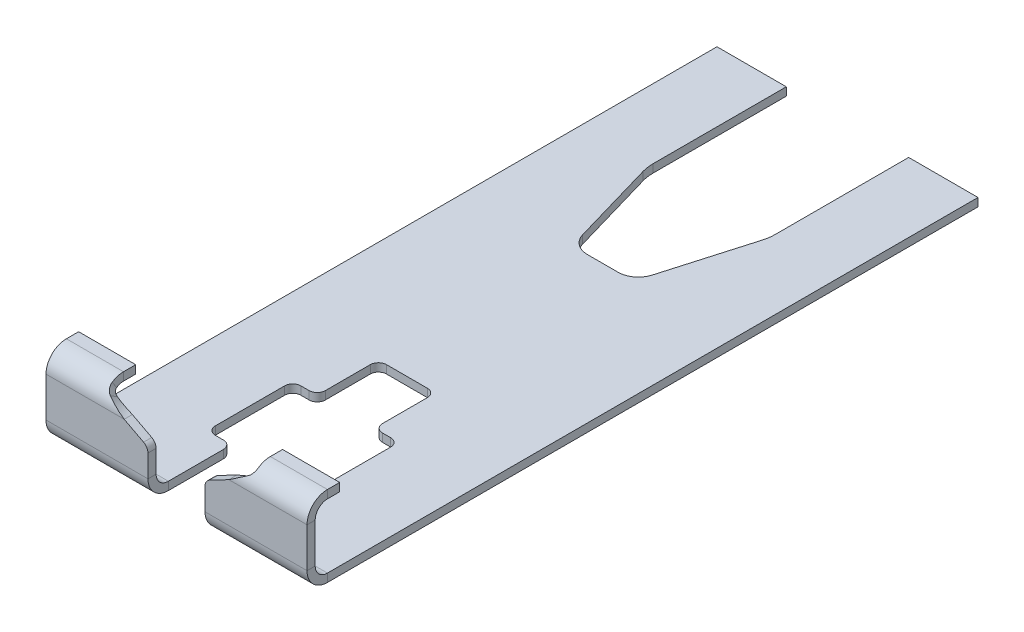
ISO-10303-21;
HEADER;
FILE_DESCRIPTION(('STEP AP214'),'2;1');
FILE_NAME('part.step','',(''),(''),'','','');
FILE_SCHEMA(('AUTOMOTIVE_DESIGN { 1 0 10303 214 1 1 1 1 }'));
ENDSEC;
DATA;
#1=APPLICATION_CONTEXT('core data for automotive mechanical design processes');
#2=APPLICATION_PROTOCOL_DEFINITION('international standard','automotive_design',2000,#1);
#3=PRODUCT_CONTEXT('',#1,'mechanical');
#4=PRODUCT('Part','Part','',(#3));
#5=PRODUCT_RELATED_PRODUCT_CATEGORY('part','',(#4));
#6=PRODUCT_DEFINITION_FORMATION('','',#4);
#7=PRODUCT_DEFINITION_CONTEXT('part definition',#1,'design');
#8=PRODUCT_DEFINITION('design','',#6,#7);
#9=PRODUCT_DEFINITION_SHAPE('','',#8);
#10=(LENGTH_UNIT() NAMED_UNIT(*) SI_UNIT(.MILLI.,.METRE.));
#11=(NAMED_UNIT(*) PLANE_ANGLE_UNIT() SI_UNIT($,.RADIAN.));
#12=(NAMED_UNIT(*) SI_UNIT($,.STERADIAN.) SOLID_ANGLE_UNIT());
#13=UNCERTAINTY_MEASURE_WITH_UNIT(LENGTH_MEASURE(1.E-05),#10,'distance_accuracy_value','');
#14=(GEOMETRIC_REPRESENTATION_CONTEXT(3) GLOBAL_UNCERTAINTY_ASSIGNED_CONTEXT((#13)) GLOBAL_UNIT_ASSIGNED_CONTEXT((#10,
#11,#12)) REPRESENTATION_CONTEXT('',''));
#15=CARTESIAN_POINT('',(0.,0.,0.));
#16=DIRECTION('',(0.,0.,1.));
#17=DIRECTION('',(1.,0.,0.));
#18=AXIS2_PLACEMENT_3D('',#15,#16,#17);
#19=CARTESIAN_POINT('',(197.680881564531,-122.140547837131,90.));
#20=DIRECTION('',(0.,0.,-1.));
#21=DIRECTION('',(0.,1.,0.));
#22=AXIS2_PLACEMENT_3D('',#19,#20,#21);
#23=PLANE('',#22);
#24=DIRECTION('',(-1.,0.,0.));
#25=VECTOR('',#24,1.);
#26=CARTESIAN_POINT('',(197.680881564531,6.00000000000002,90.));
#27=LINE('',#26,#25);
#28=CARTESIAN_POINT('',(-18.,6.00000000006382,90.));
#29=VERTEX_POINT('',#28);
#30=CARTESIAN_POINT('',(-32.,6.00000000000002,90.));
#31=VERTEX_POINT('',#30);
#32=EDGE_CURVE('E64',#29,#31,#27,.T.);
#33=ORIENTED_EDGE('',*,*,#32,.T.);
#34=DIRECTION('',(0.,1.,0.));
#35=VECTOR('',#34,1.);
#36=CARTESIAN_POINT('',(-32.,-122.140547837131,90.));
#37=LINE('',#36,#35);
#38=CARTESIAN_POINT('',(-32.,8.00000000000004,90.));
#39=VERTEX_POINT('',#38);
#40=EDGE_CURVE('E1247',#31,#39,#37,.T.);
#41=ORIENTED_EDGE('',*,*,#40,.T.);
#42=DIRECTION('',(-1.,0.,0.));
#43=VECTOR('',#42,1.);
#44=CARTESIAN_POINT('',(197.680881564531,8.00000000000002,90.));
#45=LINE('',#44,#43);
#46=CARTESIAN_POINT('',(-18.,8.0000000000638,90.));
#47=VERTEX_POINT('',#46);
#48=EDGE_CURVE('E1236',#47,#39,#45,.T.);
#49=ORIENTED_EDGE('',*,*,#48,.F.);
#50=DIRECTION('',(0.,-1.,0.));
#51=VECTOR('',#50,1.);
#52=CARTESIAN_POINT('',(-18.,8.0000000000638,90.));
#53=LINE('',#52,#51);
#54=EDGE_CURVE('E50',#47,#29,#53,.T.);
#55=ORIENTED_EDGE('',*,*,#54,.T.);
#56=EDGE_LOOP('',(#33,#41,#49,#55));
#57=FACE_BOUND('',#56,.T.);
#58=ADVANCED_FACE('F32',(#57),#23,.T.);
#59=CARTESIAN_POINT('',(197.680881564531,6.00000000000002,112.312370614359));
#60=DIRECTION('',(0.,1.,0.));
#61=DIRECTION('',(0.,0.,1.));
#62=AXIS2_PLACEMENT_3D('',#59,#60,#61);
#63=PLANE('',#62);
#64=DIRECTION('',(1.,0.,0.));
#65=VECTOR('',#64,1.);
#66=CARTESIAN_POINT('',(197.680881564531,6.00000000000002,93.));
#67=LINE('',#66,#65);
#68=CARTESIAN_POINT('',(-32.,6.00000000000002,93.));
#69=VERTEX_POINT('',#68);
#70=CARTESIAN_POINT('',(-18.,6.00000000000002,93.));
#71=VERTEX_POINT('',#70);
#72=EDGE_CURVE('E36',#69,#71,#67,.T.);
#73=ORIENTED_EDGE('',*,*,#72,.F.);
#74=DIRECTION('',(0.,0.,-1.));
#75=VECTOR('',#74,1.);
#76=CARTESIAN_POINT('',(-32.,6.00000000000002,96.));
#77=LINE('',#76,#75);
#78=EDGE_CURVE('E1240',#69,#31,#77,.T.);
#79=ORIENTED_EDGE('',*,*,#78,.T.);
#80=ORIENTED_EDGE('',*,*,#32,.F.);
#81=DIRECTION('',(0.,0.,-1.));
#82=VECTOR('',#81,1.);
#83=CARTESIAN_POINT('',(-18.,6.00000000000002,99.2831853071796));
#84=LINE('',#83,#82);
#85=EDGE_CURVE('E11',#71,#29,#84,.T.);
#86=ORIENTED_EDGE('',*,*,#85,.F.);
#87=EDGE_LOOP('',(#73,#79,#80,#86));
#88=FACE_BOUND('',#87,.T.);
#89=ADVANCED_FACE('F1217',(#88),#63,.F.);
#90=CARTESIAN_POINT('',(-32.,-122.140547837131,96.));
#91=DIRECTION('',(1.,0.,0.));
#92=DIRECTION('',(0.,0.,1.));
#93=AXIS2_PLACEMENT_3D('',#90,#91,#92);
#94=PLANE('',#93);
#95=DIRECTION('',(0.,0.,-1.));
#96=VECTOR('',#95,1.);
#97=CARTESIAN_POINT('',(-32.,8.00000000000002,96.));
#98=LINE('',#97,#96);
#99=CARTESIAN_POINT('',(-32.,8.00000000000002,93.));
#100=VERTEX_POINT('',#99);
#101=EDGE_CURVE('E1233',#100,#39,#98,.T.);
#102=ORIENTED_EDGE('',*,*,#101,.T.);
#103=ORIENTED_EDGE('',*,*,#40,.F.);
#104=ORIENTED_EDGE('',*,*,#78,.F.);
#105=DIRECTION('',(0.,1.,0.));
#106=VECTOR('',#105,1.);
#107=CARTESIAN_POINT('',(-32.,-122.140547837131,93.));
#108=LINE('',#107,#106);
#109=EDGE_CURVE('E1239',#69,#100,#108,.T.);
#110=ORIENTED_EDGE('',*,*,#109,.T.);
#111=EDGE_LOOP('',(#102,#103,#104,#110));
#112=FACE_BOUND('',#111,.T.);
#113=ADVANCED_FACE('F1220',(#112),#94,.F.);
#114=CARTESIAN_POINT('',(197.680881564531,8.00000000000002,112.312370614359));
#115=DIRECTION('',(0.,1.,0.));
#116=DIRECTION('',(0.,0.,1.));
#117=AXIS2_PLACEMENT_3D('',#114,#115,#116);
#118=PLANE('',#117);
#119=ORIENTED_EDGE('',*,*,#101,.F.);
#120=DIRECTION('',(1.,0.,0.));
#121=VECTOR('',#120,1.);
#122=CARTESIAN_POINT('',(197.680881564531,8.00000000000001,93.));
#123=LINE('',#122,#121);
#124=CARTESIAN_POINT('',(-18.,8.00000000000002,93.));
#125=VERTEX_POINT('',#124);
#126=EDGE_CURVE('E1234',#100,#125,#123,.T.);
#127=ORIENTED_EDGE('',*,*,#126,.T.);
#128=DIRECTION('',(0.,0.,1.));
#129=VECTOR('',#128,1.);
#130=CARTESIAN_POINT('',(-18.,8.00000000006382,95.3606419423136));
#131=LINE('',#130,#129);
#132=EDGE_CURVE('E1869',#47,#125,#131,.T.);
#133=ORIENTED_EDGE('',*,*,#132,.F.);
#134=ORIENTED_EDGE('',*,*,#48,.T.);
#135=EDGE_LOOP('',(#119,#127,#133,#134));
#136=FACE_BOUND('',#135,.T.);
#137=ADVANCED_FACE('F1223',(#136),#118,.T.);
#138=CARTESIAN_POINT('',(-18.,8.00000000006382,95.3606419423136));
#139=DIRECTION('',(1.,0.,0.));
#140=DIRECTION('',(0.,0.,1.));
#141=AXIS2_PLACEMENT_3D('',#138,#139,#140);
#142=PLANE('',#141);
#143=ORIENTED_EDGE('',*,*,#132,.T.);
#144=DIRECTION('',(0.,-1.,0.));
#145=VECTOR('',#144,1.);
#146=CARTESIAN_POINT('',(-18.,8.0000000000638,93.));
#147=LINE('',#146,#145);
#148=EDGE_CURVE('E42',#125,#71,#147,.T.);
#149=ORIENTED_EDGE('',*,*,#148,.T.);
#150=ORIENTED_EDGE('',*,*,#85,.T.);
#151=ORIENTED_EDGE('',*,*,#54,.F.);
#152=EDGE_LOOP('',(#143,#149,#150,#151));
#153=FACE_BOUND('',#152,.T.);
#154=ADVANCED_FACE('F34',(#153),#142,.T.);
#155=CARTESIAN_POINT('',(18.,8.00000000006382,95.3606419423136));
#156=DIRECTION('',(-1.,0.,0.));
#157=DIRECTION('',(0.,0.,-1.));
#158=AXIS2_PLACEMENT_3D('',#155,#156,#157);
#159=PLANE('',#158);
#160=DIRECTION('',(0.,0.,-1.));
#161=VECTOR('',#160,1.);
#162=CARTESIAN_POINT('',(18.,6.00000000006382,95.3606419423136));
#163=LINE('',#162,#161);
#164=CARTESIAN_POINT('',(18.,6.00000000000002,93.));
#165=VERTEX_POINT('',#164);
#166=CARTESIAN_POINT('',(18.,6.00000000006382,90.));
#167=VERTEX_POINT('',#166);
#168=EDGE_CURVE('E749',#165,#167,#163,.T.);
#169=ORIENTED_EDGE('',*,*,#168,.F.);
#170=DIRECTION('',(0.,1.,0.));
#171=VECTOR('',#170,1.);
#172=CARTESIAN_POINT('',(18.,8.0000000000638,93.));
#173=LINE('',#172,#171);
#174=CARTESIAN_POINT('',(18.,8.0000000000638,93.));
#175=VERTEX_POINT('',#174);
#176=EDGE_CURVE('E1252',#165,#175,#173,.T.);
#177=ORIENTED_EDGE('',*,*,#176,.T.);
#178=DIRECTION('',(0.,0.,-1.));
#179=VECTOR('',#178,1.);
#180=CARTESIAN_POINT('',(18.,8.00000000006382,95.3606419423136));
#181=LINE('',#180,#179);
#182=CARTESIAN_POINT('',(18.,8.0000000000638,90.));
#183=VERTEX_POINT('',#182);
#184=EDGE_CURVE('E1274',#175,#183,#181,.T.);
#185=ORIENTED_EDGE('',*,*,#184,.T.);
#186=DIRECTION('',(0.,-1.,0.));
#187=VECTOR('',#186,1.);
#188=CARTESIAN_POINT('',(18.,8.0000000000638,90.));
#189=LINE('',#188,#187);
#190=EDGE_CURVE('E1281',#183,#167,#189,.T.);
#191=ORIENTED_EDGE('',*,*,#190,.T.);
#192=EDGE_LOOP('',(#169,#177,#185,#191));
#193=FACE_BOUND('',#192,.T.);
#194=ADVANCED_FACE('F1197',(#193),#159,.T.);
#195=CARTESIAN_POINT('',(197.680881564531,8.00000000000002,112.312370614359));
#196=DIRECTION('',(0.,1.,0.));
#197=DIRECTION('',(0.,0.,1.));
#198=AXIS2_PLACEMENT_3D('',#195,#196,#197);
#199=PLANE('',#198);
#200=ORIENTED_EDGE('',*,*,#184,.F.);
#201=DIRECTION('',(1.,0.,0.));
#202=VECTOR('',#201,1.);
#203=CARTESIAN_POINT('',(197.680881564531,8.00000000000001,93.));
#204=LINE('',#203,#202);
#205=CARTESIAN_POINT('',(32.,8.00000000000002,93.));
#206=VERTEX_POINT('',#205);
#207=EDGE_CURVE('E1144',#175,#206,#204,.T.);
#208=ORIENTED_EDGE('',*,*,#207,.T.);
#209=DIRECTION('',(0.,0.,1.));
#210=VECTOR('',#209,1.);
#211=CARTESIAN_POINT('',(32.,8.00000000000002,96.));
#212=LINE('',#211,#210);
#213=CARTESIAN_POINT('',(32.,8.00000000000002,90.));
#214=VERTEX_POINT('',#213);
#215=EDGE_CURVE('E1264',#214,#206,#212,.T.);
#216=ORIENTED_EDGE('',*,*,#215,.F.);
#217=DIRECTION('',(-1.,0.,0.));
#218=VECTOR('',#217,1.);
#219=CARTESIAN_POINT('',(197.680881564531,8.00000000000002,90.));
#220=LINE('',#219,#218);
#221=EDGE_CURVE('E1261',#214,#183,#220,.T.);
#222=ORIENTED_EDGE('',*,*,#221,.T.);
#223=EDGE_LOOP('',(#200,#208,#216,#222));
#224=FACE_BOUND('',#223,.T.);
#225=ADVANCED_FACE('F1200',(#224),#199,.T.);
#226=CARTESIAN_POINT('',(197.680881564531,6.00000000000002,112.312370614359));
#227=DIRECTION('',(0.,1.,0.));
#228=DIRECTION('',(0.,0.,1.));
#229=AXIS2_PLACEMENT_3D('',#226,#227,#228);
#230=PLANE('',#229);
#231=DIRECTION('',(1.,0.,0.));
#232=VECTOR('',#231,1.);
#233=CARTESIAN_POINT('',(197.680881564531,6.00000000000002,93.));
#234=LINE('',#233,#232);
#235=CARTESIAN_POINT('',(32.,6.00000000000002,93.));
#236=VERTEX_POINT('',#235);
#237=EDGE_CURVE('E1254',#165,#236,#234,.T.);
#238=ORIENTED_EDGE('',*,*,#237,.F.);
#239=ORIENTED_EDGE('',*,*,#168,.T.);
#240=DIRECTION('',(-1.,0.,0.));
#241=VECTOR('',#240,1.);
#242=CARTESIAN_POINT('',(197.680881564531,6.00000000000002,90.));
#243=LINE('',#242,#241);
#244=CARTESIAN_POINT('',(32.,6.00000000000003,90.));
#245=VERTEX_POINT('',#244);
#246=EDGE_CURVE('E87',#245,#167,#243,.T.);
#247=ORIENTED_EDGE('',*,*,#246,.F.);
#248=DIRECTION('',(0.,0.,1.));
#249=VECTOR('',#248,1.);
#250=CARTESIAN_POINT('',(32.,6.00000000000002,96.));
#251=LINE('',#250,#249);
#252=EDGE_CURVE('E1270',#245,#236,#251,.T.);
#253=ORIENTED_EDGE('',*,*,#252,.T.);
#254=EDGE_LOOP('',(#238,#239,#247,#253));
#255=FACE_BOUND('',#254,.T.);
#256=ADVANCED_FACE('F1208',(#255),#230,.F.);
#257=CARTESIAN_POINT('',(197.680881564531,-122.140547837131,90.));
#258=DIRECTION('',(0.,0.,-1.));
#259=DIRECTION('',(0.,1.,0.));
#260=AXIS2_PLACEMENT_3D('',#257,#258,#259);
#261=PLANE('',#260);
#262=ORIENTED_EDGE('',*,*,#190,.F.);
#263=ORIENTED_EDGE('',*,*,#221,.F.);
#264=DIRECTION('',(0.,1.,0.));
#265=VECTOR('',#264,1.);
#266=CARTESIAN_POINT('',(32.,-122.140547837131,90.));
#267=LINE('',#266,#265);
#268=EDGE_CURVE('E1271',#245,#214,#267,.T.);
#269=ORIENTED_EDGE('',*,*,#268,.F.);
#270=ORIENTED_EDGE('',*,*,#246,.T.);
#271=EDGE_LOOP('',(#262,#263,#269,#270));
#272=FACE_BOUND('',#271,.T.);
#273=ADVANCED_FACE('F1204',(#272),#261,.T.);
#274=CARTESIAN_POINT('',(32.,-122.140547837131,96.));
#275=DIRECTION('',(-1.,0.,0.));
#276=DIRECTION('',(0.,0.,-1.));
#277=AXIS2_PLACEMENT_3D('',#274,#275,#276);
#278=PLANE('',#277);
#279=ORIENTED_EDGE('',*,*,#215,.T.);
#280=DIRECTION('',(0.,1.,0.));
#281=VECTOR('',#280,1.);
#282=CARTESIAN_POINT('',(32.,-122.140547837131,93.));
#283=LINE('',#282,#281);
#284=EDGE_CURVE('E1288',#236,#206,#283,.T.);
#285=ORIENTED_EDGE('',*,*,#284,.F.);
#286=ORIENTED_EDGE('',*,*,#252,.F.);
#287=ORIENTED_EDGE('',*,*,#268,.T.);
#288=EDGE_LOOP('',(#279,#285,#286,#287));
#289=FACE_BOUND('',#288,.T.);
#290=ADVANCED_FACE('F1188',(#289),#278,.F.);
#291=CARTESIAN_POINT('',(-9.00000000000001,-1.26617275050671,98.0000000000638));
#292=DIRECTION('',(0.,0.,-1.));
#293=DIRECTION('',(0.,1.,0.));
#294=AXIS2_PLACEMENT_3D('',#291,#292,#293);
#295=CYLINDRICAL_SURFACE('',#294,2.);
#296=CARTESIAN_POINT('',(-9.00000000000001,-1.26617275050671,96.0000000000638));
#297=DIRECTION('',(0.,0.,-1.));
#298=DIRECTION('',(0.,1.,0.));
#299=AXIS2_PLACEMENT_3D('',#296,#297,#298);
#300=CIRCLE('',#299,2.);
#301=CARTESIAN_POINT('',(-8.07096336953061,0.504954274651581,96.0000000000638));
#302=VERTEX_POINT('',#301);
#303=CARTESIAN_POINT('',(-7.00000000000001,-1.26617275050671,96.0000000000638));
#304=VERTEX_POINT('',#303);
#305=EDGE_CURVE('E437',#302,#304,#300,.T.);
#306=ORIENTED_EDGE('',*,*,#305,.F.);
#307=DIRECTION('',(0.,0.,-1.));
#308=VECTOR('',#307,1.);
#309=CARTESIAN_POINT('',(-8.07096336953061,0.504954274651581,98.0000000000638));
#310=LINE('',#309,#308);
#311=CARTESIAN_POINT('',(-8.07096336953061,0.504954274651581,98.0000000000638));
#312=VERTEX_POINT('',#311);
#313=EDGE_CURVE('E433',#312,#302,#310,.T.);
#314=ORIENTED_EDGE('',*,*,#313,.F.);
#315=CARTESIAN_POINT('',(-9.00000000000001,-1.26617275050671,98.0000000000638));
#316=DIRECTION('',(0.,0.,-1.));
#317=DIRECTION('',(0.,1.,0.));
#318=AXIS2_PLACEMENT_3D('',#315,#316,#317);
#319=CIRCLE('',#318,2.);
#320=CARTESIAN_POINT('',(-7.00000000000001,-1.26617275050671,98.0000000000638));
#321=VERTEX_POINT('',#320);
#322=EDGE_CURVE('E724',#312,#321,#319,.T.);
#323=ORIENTED_EDGE('',*,*,#322,.T.);
#324=DIRECTION('',(0.,0.,-1.));
#325=VECTOR('',#324,1.);
#326=CARTESIAN_POINT('',(-7.00000000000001,-1.26617275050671,98.0000000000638));
#327=LINE('',#326,#325);
#328=EDGE_CURVE('E726',#321,#304,#327,.T.);
#329=ORIENTED_EDGE('',*,*,#328,.T.);
#330=EDGE_LOOP('',(#306,#314,#323,#329));
#331=FACE_BOUND('',#330,.T.);
#332=ADVANCED_FACE('F1180',(#331),#295,.T.);
#333=CARTESIAN_POINT('',(-8.07096336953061,0.504954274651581,98.0000000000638));
#334=DIRECTION('',(0.464518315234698,0.885563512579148,0.));
#335=DIRECTION('',(0.885563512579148,-0.464518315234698,0.));
#336=AXIS2_PLACEMENT_3D('',#333,#334,#335);
#337=PLANE('',#336);
#338=CARTESIAN_POINT('',(-12.8275496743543,3.00000000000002,98.));
#339=CARTESIAN_POINT('',(-12.8275496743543,3.00000000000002,96.));
#340=B_SPLINE_CURVE_WITH_KNOTS('',1,(#338,#339),.UNSPECIFIED.,.F.,.F.,(2,2),(0.,1.),.UNSPECIFIED.);
#341=CARTESIAN_POINT('',(-12.8275496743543,3.00000000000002,98.0000000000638));
#342=VERTEX_POINT('',#341);
#343=CARTESIAN_POINT('',(-12.8275496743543,3.00000000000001,96.));
#344=VERTEX_POINT('',#343);
#345=EDGE_CURVE('E429',#342,#344,#340,.T.);
#346=ORIENTED_EDGE('',*,*,#345,.F.);
#347=DIRECTION('',(0.885563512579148,-0.464518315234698,0.));
#348=VECTOR('',#347,1.);
#349=CARTESIAN_POINT('',(-8.07096336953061,0.504954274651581,98.0000000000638));
#350=LINE('',#349,#348);
#351=EDGE_CURVE('E729',#342,#312,#350,.T.);
#352=ORIENTED_EDGE('',*,*,#351,.T.);
#353=ORIENTED_EDGE('',*,*,#313,.T.);
#354=DIRECTION('',(0.885563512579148,-0.464518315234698,0.));
#355=VECTOR('',#354,1.);
#356=CARTESIAN_POINT('',(-8.07096336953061,0.504954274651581,96.0000000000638));
#357=LINE('',#356,#355);
#358=EDGE_CURVE('E425',#344,#302,#357,.T.);
#359=ORIENTED_EDGE('',*,*,#358,.F.);
#360=EDGE_LOOP('',(#346,#352,#353,#359));
#361=FACE_BOUND('',#360,.T.);
#362=ADVANCED_FACE('F427',(#361),#337,.T.);
#363=CARTESIAN_POINT('',(197.680881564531,-10.0291853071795,96.));
#364=DIRECTION('',(0.,0.,1.));
#365=DIRECTION('',(0.,-1.,0.));
#366=AXIS2_PLACEMENT_3D('',#363,#364,#365);
#367=PLANE('',#366);
#368=DIRECTION('',(0.,1.,0.));
#369=VECTOR('',#368,1.);
#370=CARTESIAN_POINT('',(-32.,-9.7459999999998,96.));
#371=LINE('',#370,#369);
#372=CARTESIAN_POINT('',(-32.,-6.74599999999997,96.));
#373=VERTEX_POINT('',#372);
#374=CARTESIAN_POINT('',(-32.,3.,96.));
#375=VERTEX_POINT('',#374);
#376=EDGE_CURVE('E445',#373,#375,#371,.T.);
#377=ORIENTED_EDGE('',*,*,#376,.T.);
#378=DIRECTION('',(1.,0.,0.));
#379=VECTOR('',#378,1.);
#380=CARTESIAN_POINT('',(197.680881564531,3.00000000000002,96.));
#381=LINE('',#380,#379);
#382=EDGE_CURVE('E438',#375,#344,#381,.T.);
#383=ORIENTED_EDGE('',*,*,#382,.T.);
#384=ORIENTED_EDGE('',*,*,#358,.T.);
#385=ORIENTED_EDGE('',*,*,#305,.T.);
#386=DIRECTION('',(0.,1.,0.));
#387=VECTOR('',#386,1.);
#388=CARTESIAN_POINT('',(-7.00000000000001,-13.0291853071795,96.));
#389=LINE('',#388,#387);
#390=CARTESIAN_POINT('',(-7.00000000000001,-6.74599999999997,96.));
#391=VERTEX_POINT('',#390);
#392=EDGE_CURVE('E748',#391,#304,#389,.T.);
#393=ORIENTED_EDGE('',*,*,#392,.F.);
#394=DIRECTION('',(1.,0.,0.));
#395=VECTOR('',#394,1.);
#396=CARTESIAN_POINT('',(197.680881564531,-6.74599999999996,96.));
#397=LINE('',#396,#395);
#398=EDGE_CURVE('E462',#373,#391,#397,.T.);
#399=ORIENTED_EDGE('',*,*,#398,.F.);
#400=EDGE_LOOP('',(#377,#383,#384,#385,#393,#399));
#401=FACE_BOUND('',#400,.T.);
#402=ADVANCED_FACE('F442',(#401),#367,.F.);
#403=CARTESIAN_POINT('',(-32.,-9.7459999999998,-33.4756272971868));
#404=DIRECTION('',(1.,0.,0.));
#405=DIRECTION('',(0.,-1.,0.));
#406=AXIS2_PLACEMENT_3D('',#403,#404,#405);
#407=PLANE('',#406);
#408=DIRECTION('',(0.,1.,0.));
#409=VECTOR('',#408,1.);
#410=CARTESIAN_POINT('',(-32.,-9.7459999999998,98.));
#411=LINE('',#410,#409);
#412=CARTESIAN_POINT('',(-32.,-6.74599999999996,98.));
#413=VERTEX_POINT('',#412);
#414=CARTESIAN_POINT('',(-32.,3.00000000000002,98.));
#415=VERTEX_POINT('',#414);
#416=EDGE_CURVE('E733',#413,#415,#411,.T.);
#417=ORIENTED_EDGE('',*,*,#416,.T.);
#418=DIRECTION('',(0.,0.,1.));
#419=VECTOR('',#418,1.);
#420=CARTESIAN_POINT('',(-32.,3.00000000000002,-33.4756272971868));
#421=LINE('',#420,#419);
#422=EDGE_CURVE('E722',#375,#415,#421,.T.);
#423=ORIENTED_EDGE('',*,*,#422,.F.);
#424=ORIENTED_EDGE('',*,*,#376,.F.);
#425=DIRECTION('',(0.,0.,1.));
#426=VECTOR('',#425,1.);
#427=CARTESIAN_POINT('',(-32.,-6.74599999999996,-33.4756272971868));
#428=LINE('',#427,#426);
#429=EDGE_CURVE('E736',#373,#413,#428,.T.);
#430=ORIENTED_EDGE('',*,*,#429,.T.);
#431=EDGE_LOOP('',(#417,#423,#424,#430));
#432=FACE_BOUND('',#431,.T.);
#433=ADVANCED_FACE('F1185',(#432),#407,.F.);
#434=CARTESIAN_POINT('',(197.680881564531,-10.0291853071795,98.));
#435=DIRECTION('',(0.,0.,1.));
#436=DIRECTION('',(0.,-1.,0.));
#437=AXIS2_PLACEMENT_3D('',#434,#435,#436);
#438=PLANE('',#437);
#439=DIRECTION('',(1.,0.,0.));
#440=VECTOR('',#439,1.);
#441=CARTESIAN_POINT('',(197.680881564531,3.00000000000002,98.));
#442=LINE('',#441,#440);
#443=EDGE_CURVE('E461',#415,#342,#442,.T.);
#444=ORIENTED_EDGE('',*,*,#443,.F.);
#445=ORIENTED_EDGE('',*,*,#416,.F.);
#446=DIRECTION('',(1.,0.,0.));
#447=VECTOR('',#446,1.);
#448=CARTESIAN_POINT('',(197.680881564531,-6.74599999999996,98.));
#449=LINE('',#448,#447);
#450=CARTESIAN_POINT('',(-7.00000000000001,-6.74599999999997,98.));
#451=VERTEX_POINT('',#450);
#452=EDGE_CURVE('E739',#413,#451,#449,.T.);
#453=ORIENTED_EDGE('',*,*,#452,.T.);
#454=DIRECTION('',(0.,-1.,0.));
#455=VECTOR('',#454,1.);
#456=CARTESIAN_POINT('',(-7.00000000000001,-26.5268146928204,98.0000000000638));
#457=LINE('',#456,#455);
#458=EDGE_CURVE('E742',#321,#451,#457,.T.);
#459=ORIENTED_EDGE('',*,*,#458,.F.);
#460=ORIENTED_EDGE('',*,*,#322,.F.);
#461=ORIENTED_EDGE('',*,*,#351,.F.);
#462=EDGE_LOOP('',(#444,#445,#453,#459,#460,#461));
#463=FACE_BOUND('',#462,.T.);
#464=ADVANCED_FACE('F1181',(#463),#438,.T.);
#465=CARTESIAN_POINT('',(-7.00000000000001,-26.5268146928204,98.0000000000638));
#466=DIRECTION('',(1.,0.,0.));
#467=DIRECTION('',(0.,-1.,0.));
#468=AXIS2_PLACEMENT_3D('',#465,#466,#467);
#469=PLANE('',#468);
#470=ORIENTED_EDGE('',*,*,#458,.T.);
#471=DIRECTION('',(0.,0.,-1.));
#472=VECTOR('',#471,1.);
#473=CARTESIAN_POINT('',(-7.00000000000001,-6.74599999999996,98.0000000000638));
#474=LINE('',#473,#472);
#475=EDGE_CURVE('E745',#451,#391,#474,.T.);
#476=ORIENTED_EDGE('',*,*,#475,.T.);
#477=ORIENTED_EDGE('',*,*,#392,.T.);
#478=ORIENTED_EDGE('',*,*,#328,.F.);
#479=EDGE_LOOP('',(#470,#476,#477,#478));
#480=FACE_BOUND('',#479,.T.);
#481=ADVANCED_FACE('F1193',(#480),#469,.T.);
#482=CARTESIAN_POINT('',(197.680881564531,-10.0291853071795,96.));
#483=DIRECTION('',(0.,0.,1.));
#484=DIRECTION('',(0.,-1.,0.));
#485=AXIS2_PLACEMENT_3D('',#482,#483,#484);
#486=PLANE('',#485);
#487=DIRECTION('',(-0.885563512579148,-0.464518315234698,0.));
#488=VECTOR('',#487,1.);
#489=CARTESIAN_POINT('',(-22.327233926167,-15.4402819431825,96.));
#490=LINE('',#489,#488);
#491=CARTESIAN_POINT('',(12.8275496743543,3.00000000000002,96.));
#492=VERTEX_POINT('',#491);
#493=CARTESIAN_POINT('',(8.07096336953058,0.504954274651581,96.0000000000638));
#494=VERTEX_POINT('',#493);
#495=EDGE_CURVE('E692',#492,#494,#490,.T.);
#496=ORIENTED_EDGE('',*,*,#495,.F.);
#497=DIRECTION('',(1.,0.,0.));
#498=VECTOR('',#497,1.);
#499=CARTESIAN_POINT('',(197.680881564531,3.00000000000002,96.));
#500=LINE('',#499,#498);
#501=CARTESIAN_POINT('',(32.,3.00000000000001,96.));
#502=VERTEX_POINT('',#501);
#503=EDGE_CURVE('E703',#492,#502,#500,.T.);
#504=ORIENTED_EDGE('',*,*,#503,.T.);
#505=DIRECTION('',(0.,-1.,0.));
#506=VECTOR('',#505,1.);
#507=CARTESIAN_POINT('',(32.,-9.7459999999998,96.));
#508=LINE('',#507,#506);
#509=CARTESIAN_POINT('',(32.,-6.74599999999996,96.));
#510=VERTEX_POINT('',#509);
#511=EDGE_CURVE('E759',#502,#510,#508,.T.);
#512=ORIENTED_EDGE('',*,*,#511,.T.);
#513=DIRECTION('',(1.,0.,0.));
#514=VECTOR('',#513,1.);
#515=CARTESIAN_POINT('',(197.680881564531,-6.74599999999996,96.));
#516=LINE('',#515,#514);
#517=CARTESIAN_POINT('',(6.99999999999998,-6.74599999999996,96.));
#518=VERTEX_POINT('',#517);
#519=EDGE_CURVE('E707',#518,#510,#516,.T.);
#520=ORIENTED_EDGE('',*,*,#519,.F.);
#521=DIRECTION('',(0.,-1.,0.));
#522=VECTOR('',#521,1.);
#523=CARTESIAN_POINT('',(6.99999999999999,-13.0291853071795,96.));
#524=LINE('',#523,#522);
#525=CARTESIAN_POINT('',(6.99999999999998,-1.26617275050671,96.0000000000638));
#526=VERTEX_POINT('',#525);
#527=EDGE_CURVE('E708',#526,#518,#524,.T.);
#528=ORIENTED_EDGE('',*,*,#527,.F.);
#529=CARTESIAN_POINT('',(8.99999999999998,-1.26617275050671,96.0000000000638));
#530=DIRECTION('',(0.,0.,-1.));
#531=DIRECTION('',(0.,-1.,0.));
#532=AXIS2_PLACEMENT_3D('',#529,#530,#531);
#533=CIRCLE('',#532,2.);
#534=EDGE_CURVE('E706',#526,#494,#533,.T.);
#535=ORIENTED_EDGE('',*,*,#534,.T.);
#536=EDGE_LOOP('',(#496,#504,#512,#520,#528,#535));
#537=FACE_BOUND('',#536,.T.);
#538=ADVANCED_FACE('F701',(#537),#486,.F.);
#539=CARTESIAN_POINT('',(6.99999999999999,-26.5268146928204,98.0000000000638));
#540=DIRECTION('',(-1.,0.,0.));
#541=DIRECTION('',(0.,1.,0.));
#542=AXIS2_PLACEMENT_3D('',#539,#540,#541);
#543=PLANE('',#542);
#544=ORIENTED_EDGE('',*,*,#527,.T.);
#545=DIRECTION('',(0.,0.,1.));
#546=VECTOR('',#545,1.);
#547=CARTESIAN_POINT('',(6.99999999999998,-6.74599999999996,98.0000000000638));
#548=LINE('',#547,#546);
#549=CARTESIAN_POINT('',(6.99999999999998,-6.74599999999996,98.0000000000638));
#550=VERTEX_POINT('',#549);
#551=EDGE_CURVE('E720',#518,#550,#548,.T.);
#552=ORIENTED_EDGE('',*,*,#551,.T.);
#553=DIRECTION('',(0.,1.,0.));
#554=VECTOR('',#553,1.);
#555=CARTESIAN_POINT('',(6.99999999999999,-26.5268146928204,98.0000000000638));
#556=LINE('',#555,#554);
#557=CARTESIAN_POINT('',(6.99999999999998,-1.26617275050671,98.0000000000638));
#558=VERTEX_POINT('',#557);
#559=EDGE_CURVE('E772',#550,#558,#556,.T.);
#560=ORIENTED_EDGE('',*,*,#559,.T.);
#561=DIRECTION('',(0.,0.,-1.));
#562=VECTOR('',#561,1.);
#563=CARTESIAN_POINT('',(6.99999999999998,-1.26617275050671,98.0000000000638));
#564=LINE('',#563,#562);
#565=EDGE_CURVE('E764',#558,#526,#564,.T.);
#566=ORIENTED_EDGE('',*,*,#565,.T.);
#567=EDGE_LOOP('',(#544,#552,#560,#566));
#568=FACE_BOUND('',#567,.T.);
#569=ADVANCED_FACE('F1305',(#568),#543,.T.);
#570=CARTESIAN_POINT('',(197.680881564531,-10.0291853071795,98.));
#571=DIRECTION('',(0.,0.,1.));
#572=DIRECTION('',(0.,-1.,0.));
#573=AXIS2_PLACEMENT_3D('',#570,#571,#572);
#574=PLANE('',#573);
#575=DIRECTION('',(1.,0.,0.));
#576=VECTOR('',#575,1.);
#577=CARTESIAN_POINT('',(197.680881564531,3.00000000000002,98.));
#578=LINE('',#577,#576);
#579=CARTESIAN_POINT('',(12.8275496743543,3.00000000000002,98.));
#580=VERTEX_POINT('',#579);
#581=CARTESIAN_POINT('',(32.,3.,98.));
#582=VERTEX_POINT('',#581);
#583=EDGE_CURVE('E695',#580,#582,#578,.T.);
#584=ORIENTED_EDGE('',*,*,#583,.F.);
#585=DIRECTION('',(0.885563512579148,0.464518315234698,0.));
#586=VECTOR('',#585,1.);
#587=CARTESIAN_POINT('',(8.07096336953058,0.504954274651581,98.0000000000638));
#588=LINE('',#587,#586);
#589=CARTESIAN_POINT('',(8.07096336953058,0.504954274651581,98.0000000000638));
#590=VERTEX_POINT('',#589);
#591=EDGE_CURVE('E694',#590,#580,#588,.T.);
#592=ORIENTED_EDGE('',*,*,#591,.F.);
#593=CARTESIAN_POINT('',(8.99999999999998,-1.26617275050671,98.0000000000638));
#594=DIRECTION('',(0.,0.,-1.));
#595=DIRECTION('',(0.,-1.,0.));
#596=AXIS2_PLACEMENT_3D('',#593,#594,#595);
#597=CIRCLE('',#596,2.);
#598=EDGE_CURVE('E769',#558,#590,#597,.T.);
#599=ORIENTED_EDGE('',*,*,#598,.F.);
#600=ORIENTED_EDGE('',*,*,#559,.F.);
#601=DIRECTION('',(1.,0.,0.));
#602=VECTOR('',#601,1.);
#603=CARTESIAN_POINT('',(197.680881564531,-6.74599999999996,98.));
#604=LINE('',#603,#602);
#605=CARTESIAN_POINT('',(32.,-6.74599999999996,98.));
#606=VERTEX_POINT('',#605);
#607=EDGE_CURVE('E710',#550,#606,#604,.T.);
#608=ORIENTED_EDGE('',*,*,#607,.T.);
#609=DIRECTION('',(0.,-1.,0.));
#610=VECTOR('',#609,1.);
#611=CARTESIAN_POINT('',(32.,-9.7459999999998,98.));
#612=LINE('',#611,#610);
#613=EDGE_CURVE('E761',#582,#606,#612,.T.);
#614=ORIENTED_EDGE('',*,*,#613,.F.);
#615=EDGE_LOOP('',(#584,#592,#599,#600,#608,#614));
#616=FACE_BOUND('',#615,.T.);
#617=ADVANCED_FACE('F1150',(#616),#574,.T.);
#618=CARTESIAN_POINT('',(32.,-9.7459999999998,-33.4756272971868));
#619=DIRECTION('',(-1.,0.,0.));
#620=DIRECTION('',(0.,1.,0.));
#621=AXIS2_PLACEMENT_3D('',#618,#619,#620);
#622=PLANE('',#621);
#623=ORIENTED_EDGE('',*,*,#613,.T.);
#624=DIRECTION('',(0.,0.,1.));
#625=VECTOR('',#624,1.);
#626=CARTESIAN_POINT('',(32.,-6.74599999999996,-33.4756272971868));
#627=LINE('',#626,#625);
#628=EDGE_CURVE('E757',#510,#606,#627,.T.);
#629=ORIENTED_EDGE('',*,*,#628,.F.);
#630=ORIENTED_EDGE('',*,*,#511,.F.);
#631=DIRECTION('',(0.,0.,1.));
#632=VECTOR('',#631,1.);
#633=CARTESIAN_POINT('',(32.,3.00000000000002,-33.4756272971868));
#634=LINE('',#633,#632);
#635=EDGE_CURVE('E713',#502,#582,#634,.T.);
#636=ORIENTED_EDGE('',*,*,#635,.T.);
#637=EDGE_LOOP('',(#623,#629,#630,#636));
#638=FACE_BOUND('',#637,.T.);
#639=ADVANCED_FACE('F1298',(#638),#622,.F.);
#640=CARTESIAN_POINT('',(8.99999999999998,-1.26617275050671,98.0000000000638));
#641=DIRECTION('',(0.,0.,-1.));
#642=DIRECTION('',(0.,1.,0.));
#643=AXIS2_PLACEMENT_3D('',#640,#641,#642);
#644=CYLINDRICAL_SURFACE('',#643,2.);
#645=ORIENTED_EDGE('',*,*,#534,.F.);
#646=ORIENTED_EDGE('',*,*,#565,.F.);
#647=ORIENTED_EDGE('',*,*,#598,.T.);
#648=DIRECTION('',(0.,0.,-1.));
#649=VECTOR('',#648,1.);
#650=CARTESIAN_POINT('',(8.07096336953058,0.504954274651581,98.0000000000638));
#651=LINE('',#650,#649);
#652=EDGE_CURVE('E767',#590,#494,#651,.T.);
#653=ORIENTED_EDGE('',*,*,#652,.T.);
#654=EDGE_LOOP('',(#645,#646,#647,#653));
#655=FACE_BOUND('',#654,.T.);
#656=ADVANCED_FACE('F1309',(#655),#644,.T.);
#657=CARTESIAN_POINT('',(8.07096336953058,0.504954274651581,98.0000000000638));
#658=DIRECTION('',(-0.464518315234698,0.885563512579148,0.));
#659=DIRECTION('',(0.885563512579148,0.464518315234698,0.));
#660=AXIS2_PLACEMENT_3D('',#657,#658,#659);
#661=PLANE('',#660);
#662=CARTESIAN_POINT('',(12.8275496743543,3.00000000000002,96.));
#663=CARTESIAN_POINT('',(12.8275496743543,3.00000000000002,98.));
#664=B_SPLINE_CURVE_WITH_KNOTS('',1,(#662,#663),.UNSPECIFIED.,.F.,.F.,(2,2),(0.,1.),.UNSPECIFIED.);
#665=EDGE_CURVE('E683',#492,#580,#664,.T.);
#666=ORIENTED_EDGE('',*,*,#665,.F.);
#667=ORIENTED_EDGE('',*,*,#495,.T.);
#668=ORIENTED_EDGE('',*,*,#652,.F.);
#669=ORIENTED_EDGE('',*,*,#591,.T.);
#670=EDGE_LOOP('',(#666,#667,#668,#669));
#671=FACE_BOUND('',#670,.T.);
#672=ADVANCED_FACE('F690',(#671),#661,.T.);
#673=CARTESIAN_POINT('',(197.680881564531,-9.74599999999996,96.));
#674=DIRECTION('',(0.,-1.,0.));
#675=DIRECTION('',(0.,0.,-1.));
#676=AXIS2_PLACEMENT_3D('',#673,#674,#675);
#677=PLANE('',#676);
#678=DIRECTION('',(0.,0.,1.));
#679=VECTOR('',#678,1.);
#680=CARTESIAN_POINT('',(-32.,-9.74599999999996,96.));
#681=LINE('',#680,#679);
#682=CARTESIAN_POINT('',(-32.,-9.74599999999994,-66.5));
#683=VERTEX_POINT('',#682);
#684=CARTESIAN_POINT('',(-32.,-9.74599999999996,93.));
#685=VERTEX_POINT('',#684);
#686=EDGE_CURVE('E803',#683,#685,#681,.T.);
#687=ORIENTED_EDGE('',*,*,#686,.T.);
#688=DIRECTION('',(1.,0.,0.));
#689=VECTOR('',#688,1.);
#690=CARTESIAN_POINT('',(197.680881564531,-9.74599999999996,93.));
#691=LINE('',#690,#689);
#692=CARTESIAN_POINT('',(-7.00000000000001,-9.74599999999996,93.));
#693=VERTEX_POINT('',#692);
#694=EDGE_CURVE('E784',#685,#693,#691,.T.);
#695=ORIENTED_EDGE('',*,*,#694,.T.);
#696=DIRECTION('',(0.,0.,1.));
#697=VECTOR('',#696,1.);
#698=CARTESIAN_POINT('',(-7.00000000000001,-9.74599999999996,93.));
#699=LINE('',#698,#697);
#700=CARTESIAN_POINT('',(-7.00000000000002,-9.74600000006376,79.5023706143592));
#701=VERTEX_POINT('',#700);
#702=EDGE_CURVE('E790',#701,#693,#699,.T.);
#703=ORIENTED_EDGE('',*,*,#702,.F.);
#704=CARTESIAN_POINT('',(-9.00000000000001,-9.74600000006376,79.5023706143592));
#705=DIRECTION('',(0.,1.,0.));
#706=DIRECTION('',(0.,0.,1.));
#707=AXIS2_PLACEMENT_3D('',#704,#705,#706);
#708=CIRCLE('',#707,2.);
#709=CARTESIAN_POINT('',(-9.00000000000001,-9.74600000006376,77.5023706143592));
#710=VERTEX_POINT('',#709);
#711=EDGE_CURVE('E1019',#701,#710,#708,.T.);
#712=ORIENTED_EDGE('',*,*,#711,.T.);
#713=DIRECTION('',(-1.,0.,0.));
#714=VECTOR('',#713,1.);
#715=CARTESIAN_POINT('',(-11.,-9.74600000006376,77.5023706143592));
#716=LINE('',#715,#714);
#717=CARTESIAN_POINT('',(-11.,-9.74600000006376,77.5023706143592));
#718=VERTEX_POINT('',#717);
#719=EDGE_CURVE('E1016',#710,#718,#716,.T.);
#720=ORIENTED_EDGE('',*,*,#719,.T.);
#721=CARTESIAN_POINT('',(-11.,-9.74600000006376,75.5023706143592));
#722=DIRECTION('',(0.,-1.,0.));
#723=DIRECTION('',(0.,0.,-1.));
#724=AXIS2_PLACEMENT_3D('',#721,#722,#723);
#725=CIRCLE('',#724,2.);
#726=CARTESIAN_POINT('',(-13.,-9.74600000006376,75.5023706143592));
#727=VERTEX_POINT('',#726);
#728=EDGE_CURVE('E1013',#718,#727,#725,.T.);
#729=ORIENTED_EDGE('',*,*,#728,.T.);
#730=DIRECTION('',(0.,0.,-1.));
#731=VECTOR('',#730,1.);
#732=CARTESIAN_POINT('',(-13.,-9.74600000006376,58.5023706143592));
#733=LINE('',#732,#731);
#734=CARTESIAN_POINT('',(-13.,-9.74600000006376,58.5023706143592));
#735=VERTEX_POINT('',#734);
#736=EDGE_CURVE('E1010',#727,#735,#733,.T.);
#737=ORIENTED_EDGE('',*,*,#736,.T.);
#738=CARTESIAN_POINT('',(-11.,-9.74600000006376,58.5023706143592));
#739=DIRECTION('',(0.,-1.,0.));
#740=DIRECTION('',(0.,0.,-1.));
#741=AXIS2_PLACEMENT_3D('',#738,#739,#740);
#742=CIRCLE('',#741,2.);
#743=CARTESIAN_POINT('',(-11.,-9.74600000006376,56.5023706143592));
#744=VERTEX_POINT('',#743);
#745=EDGE_CURVE('E1007',#735,#744,#742,.T.);
#746=ORIENTED_EDGE('',*,*,#745,.T.);
#747=DIRECTION('',(1.,0.,0.));
#748=VECTOR('',#747,1.);
#749=CARTESIAN_POINT('',(-9.00000000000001,-9.74600000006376,56.5023706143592));
#750=LINE('',#749,#748);
#751=CARTESIAN_POINT('',(-9.00000000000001,-9.74600000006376,56.5023706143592));
#752=VERTEX_POINT('',#751);
#753=EDGE_CURVE('E1004',#744,#752,#750,.T.);
#754=ORIENTED_EDGE('',*,*,#753,.T.);
#755=CARTESIAN_POINT('',(-9.00000000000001,-9.74600000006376,54.5023706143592));
#756=DIRECTION('',(0.,1.,0.));
#757=DIRECTION('',(0.,0.,1.));
#758=AXIS2_PLACEMENT_3D('',#755,#756,#757);
#759=CIRCLE('',#758,2.);
#760=CARTESIAN_POINT('',(-7.00000000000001,-9.74600000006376,54.5023706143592));
#761=VERTEX_POINT('',#760);
#762=EDGE_CURVE('E1001',#752,#761,#759,.T.);
#763=ORIENTED_EDGE('',*,*,#762,.T.);
#764=DIRECTION('',(0.,0.,-1.));
#765=VECTOR('',#764,1.);
#766=CARTESIAN_POINT('',(-7.00000000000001,-9.74600000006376,43.5023706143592));
#767=LINE('',#766,#765);
#768=CARTESIAN_POINT('',(-7.00000000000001,-9.74600000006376,43.5023706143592));
#769=VERTEX_POINT('',#768);
#770=EDGE_CURVE('E998',#761,#769,#767,.T.);
#771=ORIENTED_EDGE('',*,*,#770,.T.);
#772=CARTESIAN_POINT('',(-5.00000000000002,-9.74600000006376,43.5023706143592));
#773=DIRECTION('',(0.,-1.,0.));
#774=DIRECTION('',(0.,0.,-1.));
#775=AXIS2_PLACEMENT_3D('',#772,#773,#774);
#776=CIRCLE('',#775,2.);
#777=CARTESIAN_POINT('',(-5.00000000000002,-9.74600000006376,41.5023706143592));
#778=VERTEX_POINT('',#777);
#779=EDGE_CURVE('E1052',#769,#778,#776,.T.);
#780=ORIENTED_EDGE('',*,*,#779,.T.);
#781=DIRECTION('',(1.,0.,0.));
#782=VECTOR('',#781,1.);
#783=CARTESIAN_POINT('',(4.99999999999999,-9.74600000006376,41.5023706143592));
#784=LINE('',#783,#782);
#785=CARTESIAN_POINT('',(4.99999999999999,-9.74600000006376,41.5023706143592));
#786=VERTEX_POINT('',#785);
#787=EDGE_CURVE('E1049',#778,#786,#784,.T.);
#788=ORIENTED_EDGE('',*,*,#787,.T.);
#789=CARTESIAN_POINT('',(4.99999999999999,-9.74600000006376,43.5023706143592));
#790=DIRECTION('',(0.,-1.,0.));
#791=DIRECTION('',(0.,0.,-1.));
#792=AXIS2_PLACEMENT_3D('',#789,#790,#791);
#793=CIRCLE('',#792,2.);
#794=CARTESIAN_POINT('',(6.99999999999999,-9.74600000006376,43.5023706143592));
#795=VERTEX_POINT('',#794);
#796=EDGE_CURVE('E1046',#786,#795,#793,.T.);
#797=ORIENTED_EDGE('',*,*,#796,.T.);
#798=DIRECTION('',(0.,0.,1.));
#799=VECTOR('',#798,1.);
#800=CARTESIAN_POINT('',(6.99999999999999,-9.74600000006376,43.5023706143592));
#801=LINE('',#800,#799);
#802=CARTESIAN_POINT('',(6.99999999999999,-9.74600000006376,54.5023706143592));
#803=VERTEX_POINT('',#802);
#804=EDGE_CURVE('E1043',#795,#803,#801,.T.);
#805=ORIENTED_EDGE('',*,*,#804,.T.);
#806=CARTESIAN_POINT('',(8.99999999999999,-9.74600000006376,54.5023706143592));
#807=DIRECTION('',(0.,1.,0.));
#808=DIRECTION('',(0.,0.,-1.));
#809=AXIS2_PLACEMENT_3D('',#806,#807,#808);
#810=CIRCLE('',#809,2.);
#811=CARTESIAN_POINT('',(8.99999999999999,-9.74600000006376,56.5023706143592));
#812=VERTEX_POINT('',#811);
#813=EDGE_CURVE('E1040',#803,#812,#810,.T.);
#814=ORIENTED_EDGE('',*,*,#813,.T.);
#815=DIRECTION('',(1.,0.,0.));
#816=VECTOR('',#815,1.);
#817=CARTESIAN_POINT('',(8.99999999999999,-9.74600000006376,56.5023706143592));
#818=LINE('',#817,#816);
#819=CARTESIAN_POINT('',(11.,-9.74600000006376,56.5023706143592));
#820=VERTEX_POINT('',#819);
#821=EDGE_CURVE('E1037',#812,#820,#818,.T.);
#822=ORIENTED_EDGE('',*,*,#821,.T.);
#823=CARTESIAN_POINT('',(11.,-9.74600000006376,58.5023706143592));
#824=DIRECTION('',(0.,-1.,0.));
#825=DIRECTION('',(0.,0.,1.));
#826=AXIS2_PLACEMENT_3D('',#823,#824,#825);
#827=CIRCLE('',#826,2.);
#828=CARTESIAN_POINT('',(13.,-9.74600000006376,58.5023706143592));
#829=VERTEX_POINT('',#828);
#830=EDGE_CURVE('E1034',#820,#829,#827,.T.);
#831=ORIENTED_EDGE('',*,*,#830,.T.);
#832=DIRECTION('',(0.,0.,1.));
#833=VECTOR('',#832,1.);
#834=CARTESIAN_POINT('',(13.,-9.74600000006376,58.5023706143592));
#835=LINE('',#834,#833);
#836=CARTESIAN_POINT('',(13.,-9.74600000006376,75.5023706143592));
#837=VERTEX_POINT('',#836);
#838=EDGE_CURVE('E1031',#829,#837,#835,.T.);
#839=ORIENTED_EDGE('',*,*,#838,.T.);
#840=CARTESIAN_POINT('',(11.,-9.74600000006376,75.5023706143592));
#841=DIRECTION('',(0.,-1.,0.));
#842=DIRECTION('',(0.,0.,1.));
#843=AXIS2_PLACEMENT_3D('',#840,#841,#842);
#844=CIRCLE('',#843,2.);
#845=CARTESIAN_POINT('',(11.,-9.74600000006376,77.5023706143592));
#846=VERTEX_POINT('',#845);
#847=EDGE_CURVE('E1028',#837,#846,#844,.T.);
#848=ORIENTED_EDGE('',*,*,#847,.T.);
#849=DIRECTION('',(-1.,0.,0.));
#850=VECTOR('',#849,1.);
#851=CARTESIAN_POINT('',(11.,-9.74600000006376,77.5023706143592));
#852=LINE('',#851,#850);
#853=CARTESIAN_POINT('',(8.99999999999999,-9.74600000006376,77.5023706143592));
#854=VERTEX_POINT('',#853);
#855=EDGE_CURVE('E1025',#846,#854,#852,.T.);
#856=ORIENTED_EDGE('',*,*,#855,.T.);
#857=CARTESIAN_POINT('',(8.99999999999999,-9.74600000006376,79.5023706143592));
#858=DIRECTION('',(0.,1.,0.));
#859=DIRECTION('',(0.,0.,-1.));
#860=AXIS2_PLACEMENT_3D('',#857,#858,#859);
#861=CIRCLE('',#860,2.);
#862=CARTESIAN_POINT('',(6.99999999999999,-9.74600000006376,79.5023706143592));
#863=VERTEX_POINT('',#862);
#864=EDGE_CURVE('E1022',#854,#863,#861,.T.);
#865=ORIENTED_EDGE('',*,*,#864,.T.);
#866=DIRECTION('',(0.,0.,-1.));
#867=VECTOR('',#866,1.);
#868=CARTESIAN_POINT('',(6.99999999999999,-9.74599999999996,93.));
#869=LINE('',#868,#867);
#870=CARTESIAN_POINT('',(6.99999999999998,-9.74599999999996,93.));
#871=VERTEX_POINT('',#870);
#872=EDGE_CURVE('E788',#871,#863,#869,.T.);
#873=ORIENTED_EDGE('',*,*,#872,.F.);
#874=CARTESIAN_POINT('',(32.,-9.74599999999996,93.));
#875=VERTEX_POINT('',#874);
#876=EDGE_CURVE('E785',#871,#875,#691,.T.);
#877=ORIENTED_EDGE('',*,*,#876,.T.);
#878=DIRECTION('',(0.,0.,-1.));
#879=VECTOR('',#878,1.);
#880=CARTESIAN_POINT('',(32.,-9.74599999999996,96.));
#881=LINE('',#880,#879);
#882=CARTESIAN_POINT('',(32.,-9.74599999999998,-66.5));
#883=VERTEX_POINT('',#882);
#884=EDGE_CURVE('E808',#875,#883,#881,.T.);
#885=ORIENTED_EDGE('',*,*,#884,.T.);
#886=DIRECTION('',(-1.,0.,0.));
#887=VECTOR('',#886,1.);
#888=CARTESIAN_POINT('',(197.680881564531,-9.74599999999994,-66.5));
#889=LINE('',#888,#887);
#890=CARTESIAN_POINT('',(15.,-9.74600000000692,-66.5));
#891=VERTEX_POINT('',#890);
#892=EDGE_CURVE('E805',#883,#891,#889,.T.);
#893=ORIENTED_EDGE('',*,*,#892,.T.);
#894=DIRECTION('',(0.,0.,1.));
#895=VECTOR('',#894,1.);
#896=CARTESIAN_POINT('',(15.,-9.74600000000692,-33.7997866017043));
#897=LINE('',#896,#895);
#898=CARTESIAN_POINT('',(15.,-9.74600000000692,-33.7997866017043));
#899=VERTEX_POINT('',#898);
#900=EDGE_CURVE('E873',#891,#899,#897,.T.);
#901=ORIENTED_EDGE('',*,*,#900,.T.);
#902=CARTESIAN_POINT('',(5.00000000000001,-9.74600000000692,-33.7997866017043));
#903=DIRECTION('',(0.,-1.,0.));
#904=DIRECTION('',(0.,0.,-1.));
#905=AXIS2_PLACEMENT_3D('',#902,#903,#904);
#906=CIRCLE('',#905,10.);
#907=CARTESIAN_POINT('',(14.6048074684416,-9.74600000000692,-31.0163223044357));
#908=VERTEX_POINT('',#907);
#909=EDGE_CURVE('E870',#899,#908,#906,.T.);
#910=ORIENTED_EDGE('',*,*,#909,.T.);
#911=DIRECTION('',(-0.278346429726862,0.,0.960480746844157));
#912=VECTOR('',#911,1.);
#913=CARTESIAN_POINT('',(8.54567267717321,-9.74600000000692,-10.1082678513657));
#914=LINE('',#913,#912);
#915=CARTESIAN_POINT('',(8.54567267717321,-9.74600000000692,-10.1082678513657));
#916=VERTEX_POINT('',#915);
#917=EDGE_CURVE('E867',#908,#916,#914,.T.);
#918=ORIENTED_EDGE('',*,*,#917,.T.);
#919=CARTESIAN_POINT('',(3.74326894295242,-9.74600000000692,-11.5));
#920=DIRECTION('',(0.,-1.,0.));
#921=DIRECTION('',(0.,0.,1.));
#922=AXIS2_PLACEMENT_3D('',#919,#920,#921);
#923=CIRCLE('',#922,5.);
#924=CARTESIAN_POINT('',(3.74326894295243,-9.74600000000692,-6.5));
#925=VERTEX_POINT('',#924);
#926=EDGE_CURVE('E891',#916,#925,#923,.T.);
#927=ORIENTED_EDGE('',*,*,#926,.T.);
#928=DIRECTION('',(-1.,0.,0.));
#929=VECTOR('',#928,1.);
#930=CARTESIAN_POINT('',(-3.74326894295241,-9.74600000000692,-6.5));
#931=LINE('',#930,#929);
#932=CARTESIAN_POINT('',(-3.74326894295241,-9.74600000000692,-6.5));
#933=VERTEX_POINT('',#932);
#934=EDGE_CURVE('E888',#925,#933,#931,.T.);
#935=ORIENTED_EDGE('',*,*,#934,.T.);
#936=CARTESIAN_POINT('',(-3.74326894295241,-9.74600000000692,-11.5));
#937=DIRECTION('',(0.,-1.,0.));
#938=DIRECTION('',(0.,0.,-1.));
#939=AXIS2_PLACEMENT_3D('',#936,#937,#938);
#940=CIRCLE('',#939,5.);
#941=CARTESIAN_POINT('',(-8.5456726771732,-9.74600000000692,-10.1082678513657));
#942=VERTEX_POINT('',#941);
#943=EDGE_CURVE('E885',#933,#942,#940,.T.);
#944=ORIENTED_EDGE('',*,*,#943,.T.);
#945=DIRECTION('',(-0.278346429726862,0.,-0.960480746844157));
#946=VECTOR('',#945,1.);
#947=CARTESIAN_POINT('',(-8.5456726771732,-9.74600000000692,-10.1082678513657));
#948=LINE('',#947,#946);
#949=CARTESIAN_POINT('',(-14.6048074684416,-9.74600000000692,-31.0163223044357));
#950=VERTEX_POINT('',#949);
#951=EDGE_CURVE('E882',#942,#950,#948,.T.);
#952=ORIENTED_EDGE('',*,*,#951,.T.);
#953=CARTESIAN_POINT('',(-5.,-9.74600000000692,-33.7997866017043));
#954=DIRECTION('',(0.,-1.,0.));
#955=DIRECTION('',(0.,0.,1.));
#956=AXIS2_PLACEMENT_3D('',#953,#954,#955);
#957=CIRCLE('',#956,10.);
#958=CARTESIAN_POINT('',(-15.,-9.74600000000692,-33.7997866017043));
#959=VERTEX_POINT('',#958);
#960=EDGE_CURVE('E879',#950,#959,#957,.T.);
#961=ORIENTED_EDGE('',*,*,#960,.T.);
#962=DIRECTION('',(0.,0.,-1.));
#963=VECTOR('',#962,1.);
#964=CARTESIAN_POINT('',(-15.,-9.74600000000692,-33.7997866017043));
#965=LINE('',#964,#963);
#966=CARTESIAN_POINT('',(-15.,-9.74600000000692,-66.5));
#967=VERTEX_POINT('',#966);
#968=EDGE_CURVE('E876',#959,#967,#965,.T.);
#969=ORIENTED_EDGE('',*,*,#968,.T.);
#970=EDGE_CURVE('E807',#967,#683,#889,.T.);
#971=ORIENTED_EDGE('',*,*,#970,.T.);
#972=EDGE_LOOP('',(#687,#695,#703,#712,#720,#729,#737,#746,#754,#763,#771,#780,#788,#797,#805,
#814,#822,#831,#839,#848,#856,#865,#873,#877,#885,#893,#901,#910,#918,#927,#935,#944,#952,#961,
#969,#971));
#973=FACE_BOUND('',#972,.T.);
#974=ADVANCED_FACE('F1320',(#973),#677,.F.);
#975=CARTESIAN_POINT('',(197.680881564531,-11.746,96.));
#976=DIRECTION('',(0.,-1.,0.));
#977=DIRECTION('',(0.,0.,-1.));
#978=AXIS2_PLACEMENT_3D('',#975,#976,#977);
#979=PLANE('',#978);
#980=DIRECTION('',(1.,0.,0.));
#981=VECTOR('',#980,1.);
#982=CARTESIAN_POINT('',(197.680881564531,-11.746,93.));
#983=LINE('',#982,#981);
#984=CARTESIAN_POINT('',(-32.,-11.746,93.));
#985=VERTEX_POINT('',#984);
#986=CARTESIAN_POINT('',(-7.00000000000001,-11.7460000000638,93.));
#987=VERTEX_POINT('',#986);
#988=EDGE_CURVE('E780',#985,#987,#983,.T.);
#989=ORIENTED_EDGE('',*,*,#988,.F.);
#990=DIRECTION('',(0.,0.,1.));
#991=VECTOR('',#990,1.);
#992=CARTESIAN_POINT('',(-32.,-11.746,96.));
#993=LINE('',#992,#991);
#994=CARTESIAN_POINT('',(-32.,-11.746,-66.5));
#995=VERTEX_POINT('',#994);
#996=EDGE_CURVE('E813',#995,#985,#993,.T.);
#997=ORIENTED_EDGE('',*,*,#996,.F.);
#998=DIRECTION('',(-1.,0.,0.));
#999=VECTOR('',#998,1.);
#1000=CARTESIAN_POINT('',(197.680881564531,-11.7459999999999,-66.5));
#1001=LINE('',#1000,#999);
#1002=CARTESIAN_POINT('',(-15.,-11.7460000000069,-66.5));
#1003=VERTEX_POINT('',#1002);
#1004=EDGE_CURVE('E812',#1003,#995,#1001,.T.);
#1005=ORIENTED_EDGE('',*,*,#1004,.F.);
#1006=DIRECTION('',(0.,0.,-1.));
#1007=VECTOR('',#1006,1.);
#1008=CARTESIAN_POINT('',(-15.,-11.7460000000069,-33.7997866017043));
#1009=LINE('',#1008,#1007);
#1010=CARTESIAN_POINT('',(-15.,-11.7460000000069,-33.7997866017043));
#1011=VERTEX_POINT('',#1010);
#1012=EDGE_CURVE('E855',#1011,#1003,#1009,.T.);
#1013=ORIENTED_EDGE('',*,*,#1012,.F.);
#1014=CARTESIAN_POINT('',(-5.,-11.7460000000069,-33.7997866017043));
#1015=DIRECTION('',(0.,-1.,0.));
#1016=DIRECTION('',(0.,0.,1.));
#1017=AXIS2_PLACEMENT_3D('',#1014,#1015,#1016);
#1018=CIRCLE('',#1017,10.);
#1019=CARTESIAN_POINT('',(-14.6048074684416,-11.7460000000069,-31.0163223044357));
#1020=VERTEX_POINT('',#1019);
#1021=EDGE_CURVE('E857',#1020,#1011,#1018,.T.);
#1022=ORIENTED_EDGE('',*,*,#1021,.F.);
#1023=DIRECTION('',(-0.278346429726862,0.,-0.960480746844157));
#1024=VECTOR('',#1023,1.);
#1025=CARTESIAN_POINT('',(-8.5456726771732,-11.7460000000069,-10.1082678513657));
#1026=LINE('',#1025,#1024);
#1027=CARTESIAN_POINT('',(-8.5456726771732,-11.7460000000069,-10.1082678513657));
#1028=VERTEX_POINT('',#1027);
#1029=EDGE_CURVE('E859',#1028,#1020,#1026,.T.);
#1030=ORIENTED_EDGE('',*,*,#1029,.F.);
#1031=CARTESIAN_POINT('',(-3.74326894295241,-11.7460000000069,-11.5));
#1032=DIRECTION('',(0.,-1.,0.));
#1033=DIRECTION('',(0.,0.,-1.));
#1034=AXIS2_PLACEMENT_3D('',#1031,#1032,#1033);
#1035=CIRCLE('',#1034,5.);
#1036=CARTESIAN_POINT('',(-3.74326894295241,-11.7460000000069,-6.5));
#1037=VERTEX_POINT('',#1036);
#1038=EDGE_CURVE('E861',#1037,#1028,#1035,.T.);
#1039=ORIENTED_EDGE('',*,*,#1038,.F.);
#1040=DIRECTION('',(-1.,0.,0.));
#1041=VECTOR('',#1040,1.);
#1042=CARTESIAN_POINT('',(-3.74326894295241,-11.7460000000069,-6.5));
#1043=LINE('',#1042,#1041);
#1044=CARTESIAN_POINT('',(3.74326894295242,-11.7460000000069,-6.5));
#1045=VERTEX_POINT('',#1044);
#1046=EDGE_CURVE('E863',#1045,#1037,#1043,.T.);
#1047=ORIENTED_EDGE('',*,*,#1046,.F.);
#1048=CARTESIAN_POINT('',(3.74326894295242,-11.7460000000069,-11.5));
#1049=DIRECTION('',(0.,-1.,0.));
#1050=DIRECTION('',(0.,0.,1.));
#1051=AXIS2_PLACEMENT_3D('',#1048,#1049,#1050);
#1052=CIRCLE('',#1051,5.);
#1053=CARTESIAN_POINT('',(8.54567267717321,-11.7460000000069,-10.1082678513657));
#1054=VERTEX_POINT('',#1053);
#1055=EDGE_CURVE('E865',#1054,#1045,#1052,.T.);
#1056=ORIENTED_EDGE('',*,*,#1055,.F.);
#1057=DIRECTION('',(-0.278346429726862,0.,0.960480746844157));
#1058=VECTOR('',#1057,1.);
#1059=CARTESIAN_POINT('',(8.54567267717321,-11.7460000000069,-10.1082678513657));
#1060=LINE('',#1059,#1058);
#1061=CARTESIAN_POINT('',(14.6048074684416,-11.7459999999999,-31.0163223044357));
#1062=VERTEX_POINT('',#1061);
#1063=EDGE_CURVE('E848',#1062,#1054,#1060,.T.);
#1064=ORIENTED_EDGE('',*,*,#1063,.F.);
#1065=CARTESIAN_POINT('',(5.00000000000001,-11.7460000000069,-33.7997866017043));
#1066=DIRECTION('',(0.,-1.,0.));
#1067=DIRECTION('',(0.,0.,-1.));
#1068=AXIS2_PLACEMENT_3D('',#1065,#1066,#1067);
#1069=CIRCLE('',#1068,10.);
#1070=CARTESIAN_POINT('',(15.,-11.7460000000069,-33.7997866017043));
#1071=VERTEX_POINT('',#1070);
#1072=EDGE_CURVE('E850',#1071,#1062,#1069,.T.);
#1073=ORIENTED_EDGE('',*,*,#1072,.F.);
#1074=DIRECTION('',(0.,0.,1.));
#1075=VECTOR('',#1074,1.);
#1076=CARTESIAN_POINT('',(15.,-11.7460000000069,-33.7997866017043));
#1077=LINE('',#1076,#1075);
#1078=CARTESIAN_POINT('',(15.,-11.7460000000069,-66.5));
#1079=VERTEX_POINT('',#1078);
#1080=EDGE_CURVE('E853',#1079,#1071,#1077,.T.);
#1081=ORIENTED_EDGE('',*,*,#1080,.F.);
#1082=CARTESIAN_POINT('',(32.,-11.7459999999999,-66.5));
#1083=VERTEX_POINT('',#1082);
#1084=EDGE_CURVE('E810',#1083,#1079,#1001,.T.);
#1085=ORIENTED_EDGE('',*,*,#1084,.F.);
#1086=DIRECTION('',(0.,0.,-1.));
#1087=VECTOR('',#1086,1.);
#1088=CARTESIAN_POINT('',(32.,-11.746,96.));
#1089=LINE('',#1088,#1087);
#1090=CARTESIAN_POINT('',(32.,-11.746,93.));
#1091=VERTEX_POINT('',#1090);
#1092=EDGE_CURVE('E816',#1091,#1083,#1089,.T.);
#1093=ORIENTED_EDGE('',*,*,#1092,.F.);
#1094=CARTESIAN_POINT('',(6.99999999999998,-11.746,93.));
#1095=VERTEX_POINT('',#1094);
#1096=EDGE_CURVE('E781',#1095,#1091,#983,.T.);
#1097=ORIENTED_EDGE('',*,*,#1096,.F.);
#1098=DIRECTION('',(0.,0.,1.));
#1099=VECTOR('',#1098,1.);
#1100=CARTESIAN_POINT('',(6.99999999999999,-11.7460000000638,79.5023706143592));
#1101=LINE('',#1100,#1099);
#1102=CARTESIAN_POINT('',(6.99999999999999,-11.7460000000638,79.5023706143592));
#1103=VERTEX_POINT('',#1102);
#1104=EDGE_CURVE('E972',#1103,#1095,#1101,.T.);
#1105=ORIENTED_EDGE('',*,*,#1104,.F.);
#1106=CARTESIAN_POINT('',(8.99999999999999,-11.7460000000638,79.5023706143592));
#1107=DIRECTION('',(0.,1.,0.));
#1108=DIRECTION('',(0.,0.,-1.));
#1109=AXIS2_PLACEMENT_3D('',#1106,#1107,#1108);
#1110=CIRCLE('',#1109,2.);
#1111=CARTESIAN_POINT('',(8.99999999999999,-11.7460000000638,77.5023706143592));
#1112=VERTEX_POINT('',#1111);
#1113=EDGE_CURVE('E975',#1112,#1103,#1110,.T.);
#1114=ORIENTED_EDGE('',*,*,#1113,.F.);
#1115=DIRECTION('',(-1.,0.,0.));
#1116=VECTOR('',#1115,1.);
#1117=CARTESIAN_POINT('',(11.,-11.7460000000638,77.5023706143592));
#1118=LINE('',#1117,#1116);
#1119=CARTESIAN_POINT('',(11.,-11.7460000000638,77.5023706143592));
#1120=VERTEX_POINT('',#1119);
#1121=EDGE_CURVE('E978',#1120,#1112,#1118,.T.);
#1122=ORIENTED_EDGE('',*,*,#1121,.F.);
#1123=CARTESIAN_POINT('',(11.,-11.7460000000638,75.5023706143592));
#1124=DIRECTION('',(0.,-1.,0.));
#1125=DIRECTION('',(0.,0.,1.));
#1126=AXIS2_PLACEMENT_3D('',#1123,#1124,#1125);
#1127=CIRCLE('',#1126,2.);
#1128=CARTESIAN_POINT('',(13.,-11.7460000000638,75.5023706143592));
#1129=VERTEX_POINT('',#1128);
#1130=EDGE_CURVE('E980',#1129,#1120,#1127,.T.);
#1131=ORIENTED_EDGE('',*,*,#1130,.F.);
#1132=DIRECTION('',(0.,0.,1.));
#1133=VECTOR('',#1132,1.);
#1134=CARTESIAN_POINT('',(13.,-11.7460000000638,58.5023706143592));
#1135=LINE('',#1134,#1133);
#1136=CARTESIAN_POINT('',(13.,-11.7460000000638,58.5023706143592));
#1137=VERTEX_POINT('',#1136);
#1138=EDGE_CURVE('E982',#1137,#1129,#1135,.T.);
#1139=ORIENTED_EDGE('',*,*,#1138,.F.);
#1140=CARTESIAN_POINT('',(11.,-11.7460000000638,58.5023706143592));
#1141=DIRECTION('',(0.,-1.,0.));
#1142=DIRECTION('',(0.,0.,1.));
#1143=AXIS2_PLACEMENT_3D('',#1140,#1141,#1142);
#1144=CIRCLE('',#1143,2.);
#1145=CARTESIAN_POINT('',(11.,-11.7460000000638,56.5023706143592));
#1146=VERTEX_POINT('',#1145);
#1147=EDGE_CURVE('E984',#1146,#1137,#1144,.T.);
#1148=ORIENTED_EDGE('',*,*,#1147,.F.);
#1149=DIRECTION('',(1.,0.,0.));
#1150=VECTOR('',#1149,1.);
#1151=CARTESIAN_POINT('',(8.99999999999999,-11.7460000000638,56.5023706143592));
#1152=LINE('',#1151,#1150);
#1153=CARTESIAN_POINT('',(8.99999999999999,-11.7460000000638,56.5023706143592));
#1154=VERTEX_POINT('',#1153);
#1155=EDGE_CURVE('E986',#1154,#1146,#1152,.T.);
#1156=ORIENTED_EDGE('',*,*,#1155,.F.);
#1157=CARTESIAN_POINT('',(8.99999999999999,-11.7460000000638,54.5023706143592));
#1158=DIRECTION('',(0.,1.,0.));
#1159=DIRECTION('',(0.,0.,-1.));
#1160=AXIS2_PLACEMENT_3D('',#1157,#1158,#1159);
#1161=CIRCLE('',#1160,2.);
#1162=CARTESIAN_POINT('',(6.99999999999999,-11.7460000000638,54.5023706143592));
#1163=VERTEX_POINT('',#1162);
#1164=EDGE_CURVE('E988',#1163,#1154,#1161,.T.);
#1165=ORIENTED_EDGE('',*,*,#1164,.F.);
#1166=DIRECTION('',(0.,0.,1.));
#1167=VECTOR('',#1166,1.);
#1168=CARTESIAN_POINT('',(6.99999999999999,-11.7460000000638,43.5023706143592));
#1169=LINE('',#1168,#1167);
#1170=CARTESIAN_POINT('',(6.99999999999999,-11.7460000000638,43.5023706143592));
#1171=VERTEX_POINT('',#1170);
#1172=EDGE_CURVE('E990',#1171,#1163,#1169,.T.);
#1173=ORIENTED_EDGE('',*,*,#1172,.F.);
#1174=CARTESIAN_POINT('',(4.99999999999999,-11.7460000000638,43.5023706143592));
#1175=DIRECTION('',(0.,-1.,0.));
#1176=DIRECTION('',(0.,0.,-1.));
#1177=AXIS2_PLACEMENT_3D('',#1174,#1175,#1176);
#1178=CIRCLE('',#1177,2.);
#1179=CARTESIAN_POINT('',(4.99999999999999,-11.7460000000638,41.5023706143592));
#1180=VERTEX_POINT('',#1179);
#1181=EDGE_CURVE('E992',#1180,#1171,#1178,.T.);
#1182=ORIENTED_EDGE('',*,*,#1181,.F.);
#1183=DIRECTION('',(1.,0.,0.));
#1184=VECTOR('',#1183,1.);
#1185=CARTESIAN_POINT('',(4.99999999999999,-11.7460000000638,41.5023706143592));
#1186=LINE('',#1185,#1184);
#1187=CARTESIAN_POINT('',(-5.00000000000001,-11.7460000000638,41.5023706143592));
#1188=VERTEX_POINT('',#1187);
#1189=EDGE_CURVE('E994',#1188,#1180,#1186,.T.);
#1190=ORIENTED_EDGE('',*,*,#1189,.F.);
#1191=CARTESIAN_POINT('',(-5.00000000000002,-11.7460000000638,43.5023706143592));
#1192=DIRECTION('',(0.,-1.,0.));
#1193=DIRECTION('',(0.,0.,-1.));
#1194=AXIS2_PLACEMENT_3D('',#1191,#1192,#1193);
#1195=CIRCLE('',#1194,2.);
#1196=CARTESIAN_POINT('',(-7.00000000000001,-11.7460000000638,43.5023706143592));
#1197=VERTEX_POINT('',#1196);
#1198=EDGE_CURVE('E996',#1197,#1188,#1195,.T.);
#1199=ORIENTED_EDGE('',*,*,#1198,.F.);
#1200=DIRECTION('',(0.,0.,-1.));
#1201=VECTOR('',#1200,1.);
#1202=CARTESIAN_POINT('',(-7.00000000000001,-11.7460000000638,43.5023706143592));
#1203=LINE('',#1202,#1201);
#1204=CARTESIAN_POINT('',(-7.00000000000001,-11.7460000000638,54.5023706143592));
#1205=VERTEX_POINT('',#1204);
#1206=EDGE_CURVE('E954',#1205,#1197,#1203,.T.);
#1207=ORIENTED_EDGE('',*,*,#1206,.F.);
#1208=CARTESIAN_POINT('',(-9.00000000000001,-11.7460000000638,54.5023706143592));
#1209=DIRECTION('',(0.,1.,0.));
#1210=DIRECTION('',(0.,0.,1.));
#1211=AXIS2_PLACEMENT_3D('',#1208,#1209,#1210);
#1212=CIRCLE('',#1211,2.);
#1213=CARTESIAN_POINT('',(-9.00000000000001,-11.7460000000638,56.5023706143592));
#1214=VERTEX_POINT('',#1213);
#1215=EDGE_CURVE('E956',#1214,#1205,#1212,.T.);
#1216=ORIENTED_EDGE('',*,*,#1215,.F.);
#1217=DIRECTION('',(1.,0.,0.));
#1218=VECTOR('',#1217,1.);
#1219=CARTESIAN_POINT('',(-9.00000000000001,-11.7460000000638,56.5023706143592));
#1220=LINE('',#1219,#1218);
#1221=CARTESIAN_POINT('',(-11.,-11.7460000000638,56.5023706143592));
#1222=VERTEX_POINT('',#1221);
#1223=EDGE_CURVE('E958',#1222,#1214,#1220,.T.);
#1224=ORIENTED_EDGE('',*,*,#1223,.F.);
#1225=CARTESIAN_POINT('',(-11.,-11.7460000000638,58.5023706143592));
#1226=DIRECTION('',(0.,-1.,0.));
#1227=DIRECTION('',(0.,0.,-1.));
#1228=AXIS2_PLACEMENT_3D('',#1225,#1226,#1227);
#1229=CIRCLE('',#1228,2.);
#1230=CARTESIAN_POINT('',(-13.,-11.7460000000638,58.5023706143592));
#1231=VERTEX_POINT('',#1230);
#1232=EDGE_CURVE('E960',#1231,#1222,#1229,.T.);
#1233=ORIENTED_EDGE('',*,*,#1232,.F.);
#1234=DIRECTION('',(0.,0.,-1.));
#1235=VECTOR('',#1234,1.);
#1236=CARTESIAN_POINT('',(-13.,-11.7460000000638,58.5023706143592));
#1237=LINE('',#1236,#1235);
#1238=CARTESIAN_POINT('',(-13.,-11.7460000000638,75.5023706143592));
#1239=VERTEX_POINT('',#1238);
#1240=EDGE_CURVE('E962',#1239,#1231,#1237,.T.);
#1241=ORIENTED_EDGE('',*,*,#1240,.F.);
#1242=CARTESIAN_POINT('',(-11.,-11.7460000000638,75.5023706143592));
#1243=DIRECTION('',(0.,-1.,0.));
#1244=DIRECTION('',(0.,0.,-1.));
#1245=AXIS2_PLACEMENT_3D('',#1242,#1243,#1244);
#1246=CIRCLE('',#1245,2.);
#1247=CARTESIAN_POINT('',(-11.,-11.7460000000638,77.5023706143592));
#1248=VERTEX_POINT('',#1247);
#1249=EDGE_CURVE('E964',#1248,#1239,#1246,.T.);
#1250=ORIENTED_EDGE('',*,*,#1249,.F.);
#1251=DIRECTION('',(-1.,0.,0.));
#1252=VECTOR('',#1251,1.);
#1253=CARTESIAN_POINT('',(-11.,-11.7460000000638,77.5023706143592));
#1254=LINE('',#1253,#1252);
#1255=CARTESIAN_POINT('',(-9.00000000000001,-11.7460000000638,77.5023706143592));
#1256=VERTEX_POINT('',#1255);
#1257=EDGE_CURVE('E966',#1256,#1248,#1254,.T.);
#1258=ORIENTED_EDGE('',*,*,#1257,.F.);
#1259=CARTESIAN_POINT('',(-9.00000000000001,-11.7460000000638,79.5023706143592));
#1260=DIRECTION('',(0.,1.,0.));
#1261=DIRECTION('',(0.,0.,1.));
#1262=AXIS2_PLACEMENT_3D('',#1259,#1260,#1261);
#1263=CIRCLE('',#1262,2.);
#1264=CARTESIAN_POINT('',(-7.00000000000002,-11.7460000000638,79.5023706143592));
#1265=VERTEX_POINT('',#1264);
#1266=EDGE_CURVE('E968',#1265,#1256,#1263,.T.);
#1267=ORIENTED_EDGE('',*,*,#1266,.F.);
#1268=DIRECTION('',(0.,0.,-1.));
#1269=VECTOR('',#1268,1.);
#1270=CARTESIAN_POINT('',(-7.00000000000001,-11.7460000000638,79.5023706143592));
#1271=LINE('',#1270,#1269);
#1272=EDGE_CURVE('E970',#987,#1265,#1271,.T.);
#1273=ORIENTED_EDGE('',*,*,#1272,.F.);
#1274=EDGE_LOOP('',(#989,#997,#1005,#1013,#1022,#1030,#1039,#1047,#1056,#1064,#1073,#1081,#1085,
#1093,#1097,#1105,#1114,#1122,#1131,#1139,#1148,#1156,#1165,#1173,#1182,#1190,#1199,#1207,#1216,
#1224,#1233,#1241,#1250,#1258,#1267,#1273));
#1275=FACE_BOUND('',#1274,.T.);
#1276=ADVANCED_FACE('F1340',(#1275),#979,.T.);
#1277=CARTESIAN_POINT('',(197.680881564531,333.976271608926,-66.5));
#1278=DIRECTION('',(0.,0.,1.));
#1279=DIRECTION('',(0.,-1.,0.));
#1280=AXIS2_PLACEMENT_3D('',#1277,#1278,#1279);
#1281=PLANE('',#1280);
#1282=ORIENTED_EDGE('',*,*,#1004,.T.);
#1283=DIRECTION('',(0.,-1.,0.));
#1284=VECTOR('',#1283,1.);
#1285=CARTESIAN_POINT('',(-32.,333.976271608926,-66.5));
#1286=LINE('',#1285,#1284);
#1287=EDGE_CURVE('E800',#683,#995,#1286,.T.);
#1288=ORIENTED_EDGE('',*,*,#1287,.F.);
#1289=ORIENTED_EDGE('',*,*,#970,.F.);
#1290=DIRECTION('',(0.,1.,0.));
#1291=VECTOR('',#1290,1.);
#1292=CARTESIAN_POINT('',(-15.,-11.7460000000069,-66.5));
#1293=LINE('',#1292,#1291);
#1294=EDGE_CURVE('E834',#1003,#967,#1293,.T.);
#1295=ORIENTED_EDGE('',*,*,#1294,.F.);
#1296=EDGE_LOOP('',(#1282,#1288,#1289,#1295));
#1297=FACE_BOUND('',#1296,.T.);
#1298=ADVANCED_FACE('F1371',(#1297),#1281,.F.);
#1299=DIRECTION('',(0.,1.,0.));
#1300=VECTOR('',#1299,1.);
#1301=CARTESIAN_POINT('',(15.,-11.7460000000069,-66.5));
#1302=LINE('',#1301,#1300);
#1303=EDGE_CURVE('E836',#1079,#891,#1302,.T.);
#1304=ORIENTED_EDGE('',*,*,#1303,.T.);
#1305=ORIENTED_EDGE('',*,*,#892,.F.);
#1306=DIRECTION('',(0.,-1.,0.));
#1307=VECTOR('',#1306,1.);
#1308=CARTESIAN_POINT('',(32.,333.976271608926,-66.5));
#1309=LINE('',#1308,#1307);
#1310=EDGE_CURVE('E798',#883,#1083,#1309,.T.);
#1311=ORIENTED_EDGE('',*,*,#1310,.T.);
#1312=ORIENTED_EDGE('',*,*,#1084,.T.);
#1313=EDGE_LOOP('',(#1304,#1305,#1311,#1312));
#1314=FACE_BOUND('',#1313,.T.);
#1315=ADVANCED_FACE('F1328',(#1314),#1281,.F.);
#1316=CARTESIAN_POINT('',(-32.,333.976271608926,96.));
#1317=DIRECTION('',(1.,0.,0.));
#1318=DIRECTION('',(0.,0.,-1.));
#1319=AXIS2_PLACEMENT_3D('',#1316,#1317,#1318);
#1320=PLANE('',#1319);
#1321=ORIENTED_EDGE('',*,*,#996,.T.);
#1322=DIRECTION('',(0.,-1.,0.));
#1323=VECTOR('',#1322,1.);
#1324=CARTESIAN_POINT('',(-32.,333.976271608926,93.));
#1325=LINE('',#1324,#1323);
#1326=EDGE_CURVE('E792',#685,#985,#1325,.T.);
#1327=ORIENTED_EDGE('',*,*,#1326,.F.);
#1328=ORIENTED_EDGE('',*,*,#686,.F.);
#1329=ORIENTED_EDGE('',*,*,#1287,.T.);
#1330=EDGE_LOOP('',(#1321,#1327,#1328,#1329));
#1331=FACE_BOUND('',#1330,.T.);
#1332=ADVANCED_FACE('F1375',(#1331),#1320,.F.);
#1333=CARTESIAN_POINT('',(32.,333.976271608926,96.));
#1334=DIRECTION('',(-1.,0.,0.));
#1335=DIRECTION('',(0.,0.,1.));
#1336=AXIS2_PLACEMENT_3D('',#1333,#1334,#1335);
#1337=PLANE('',#1336);
#1338=ORIENTED_EDGE('',*,*,#1092,.T.);
#1339=ORIENTED_EDGE('',*,*,#1310,.F.);
#1340=ORIENTED_EDGE('',*,*,#884,.F.);
#1341=DIRECTION('',(0.,-1.,0.));
#1342=VECTOR('',#1341,1.);
#1343=CARTESIAN_POINT('',(32.,333.976271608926,93.));
#1344=LINE('',#1343,#1342);
#1345=EDGE_CURVE('E795',#875,#1091,#1344,.T.);
#1346=ORIENTED_EDGE('',*,*,#1345,.T.);
#1347=EDGE_LOOP('',(#1338,#1339,#1340,#1346));
#1348=FACE_BOUND('',#1347,.T.);
#1349=ADVANCED_FACE('F1324',(#1348),#1337,.F.);
#1350=CARTESIAN_POINT('',(3.74326894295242,-11.7460000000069,-11.5));
#1351=DIRECTION('',(0.,1.,0.));
#1352=DIRECTION('',(0.,0.,1.));
#1353=AXIS2_PLACEMENT_3D('',#1350,#1351,#1352);
#1354=CYLINDRICAL_SURFACE('',#1353,5.);
#1355=ORIENTED_EDGE('',*,*,#926,.F.);
#1356=DIRECTION('',(0.,1.,0.));
#1357=VECTOR('',#1356,1.);
#1358=CARTESIAN_POINT('',(8.54567267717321,-11.7460000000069,-10.1082678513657));
#1359=LINE('',#1358,#1357);
#1360=EDGE_CURVE('E845',#1054,#916,#1359,.T.);
#1361=ORIENTED_EDGE('',*,*,#1360,.F.);
#1362=ORIENTED_EDGE('',*,*,#1055,.T.);
#1363=DIRECTION('',(0.,1.,0.));
#1364=VECTOR('',#1363,1.);
#1365=CARTESIAN_POINT('',(3.74326894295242,-11.7460000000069,-6.5));
#1366=LINE('',#1365,#1364);
#1367=EDGE_CURVE('E819',#1045,#925,#1366,.T.);
#1368=ORIENTED_EDGE('',*,*,#1367,.T.);
#1369=EDGE_LOOP('',(#1355,#1361,#1362,#1368));
#1370=FACE_BOUND('',#1369,.T.);
#1371=ADVANCED_FACE('F1347',(#1370),#1354,.F.);
#1372=CARTESIAN_POINT('',(-3.74326894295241,-11.7460000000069,-6.5));
#1373=DIRECTION('',(0.,0.,-1.));
#1374=DIRECTION('',(-1.,0.,0.));
#1375=AXIS2_PLACEMENT_3D('',#1372,#1373,#1374);
#1376=PLANE('',#1375);
#1377=ORIENTED_EDGE('',*,*,#934,.F.);
#1378=ORIENTED_EDGE('',*,*,#1367,.F.);
#1379=ORIENTED_EDGE('',*,*,#1046,.T.);
#1380=DIRECTION('',(0.,1.,0.));
#1381=VECTOR('',#1380,1.);
#1382=CARTESIAN_POINT('',(-3.74326894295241,-11.7460000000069,-6.5));
#1383=LINE('',#1382,#1381);
#1384=EDGE_CURVE('E822',#1037,#933,#1383,.T.);
#1385=ORIENTED_EDGE('',*,*,#1384,.T.);
#1386=EDGE_LOOP('',(#1377,#1378,#1379,#1385));
#1387=FACE_BOUND('',#1386,.T.);
#1388=ADVANCED_FACE('F1350',(#1387),#1376,.T.);
#1389=CARTESIAN_POINT('',(-3.74326894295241,-11.7460000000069,-11.5));
#1390=DIRECTION('',(0.,1.,0.));
#1391=DIRECTION('',(0.,0.,1.));
#1392=AXIS2_PLACEMENT_3D('',#1389,#1390,#1391);
#1393=CYLINDRICAL_SURFACE('',#1392,5.);
#1394=ORIENTED_EDGE('',*,*,#943,.F.);
#1395=ORIENTED_EDGE('',*,*,#1384,.F.);
#1396=ORIENTED_EDGE('',*,*,#1038,.T.);
#1397=DIRECTION('',(0.,1.,0.));
#1398=VECTOR('',#1397,1.);
#1399=CARTESIAN_POINT('',(-8.5456726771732,-11.7460000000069,-10.1082678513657));
#1400=LINE('',#1399,#1398);
#1401=EDGE_CURVE('E825',#1028,#942,#1400,.T.);
#1402=ORIENTED_EDGE('',*,*,#1401,.T.);
#1403=EDGE_LOOP('',(#1394,#1395,#1396,#1402));
#1404=FACE_BOUND('',#1403,.T.);
#1405=ADVANCED_FACE('F1354',(#1404),#1393,.F.);
#1406=CARTESIAN_POINT('',(-8.5456726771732,-11.7460000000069,-10.1082678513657));
#1407=DIRECTION('',(0.960480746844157,0.,-0.278346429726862));
#1408=DIRECTION('',(-0.278346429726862,0.,-0.960480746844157));
#1409=AXIS2_PLACEMENT_3D('',#1406,#1407,#1408);
#1410=PLANE('',#1409);
#1411=ORIENTED_EDGE('',*,*,#951,.F.);
#1412=ORIENTED_EDGE('',*,*,#1401,.F.);
#1413=ORIENTED_EDGE('',*,*,#1029,.T.);
#1414=DIRECTION('',(0.,1.,0.));
#1415=VECTOR('',#1414,1.);
#1416=CARTESIAN_POINT('',(-14.6048074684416,-11.7460000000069,-31.0163223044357));
#1417=LINE('',#1416,#1415);
#1418=EDGE_CURVE('E828',#1020,#950,#1417,.T.);
#1419=ORIENTED_EDGE('',*,*,#1418,.T.);
#1420=EDGE_LOOP('',(#1411,#1412,#1413,#1419));
#1421=FACE_BOUND('',#1420,.T.);
#1422=ADVANCED_FACE('F1361',(#1421),#1410,.T.);
#1423=CARTESIAN_POINT('',(-5.,-11.7460000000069,-33.7997866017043));
#1424=DIRECTION('',(0.,1.,0.));
#1425=DIRECTION('',(0.,0.,1.));
#1426=AXIS2_PLACEMENT_3D('',#1423,#1424,#1425);
#1427=CYLINDRICAL_SURFACE('',#1426,10.);
#1428=ORIENTED_EDGE('',*,*,#960,.F.);
#1429=ORIENTED_EDGE('',*,*,#1418,.F.);
#1430=ORIENTED_EDGE('',*,*,#1021,.T.);
#1431=DIRECTION('',(0.,1.,0.));
#1432=VECTOR('',#1431,1.);
#1433=CARTESIAN_POINT('',(-15.,-11.7460000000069,-33.7997866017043));
#1434=LINE('',#1433,#1432);
#1435=EDGE_CURVE('E831',#1011,#959,#1434,.T.);
#1436=ORIENTED_EDGE('',*,*,#1435,.T.);
#1437=EDGE_LOOP('',(#1428,#1429,#1430,#1436));
#1438=FACE_BOUND('',#1437,.T.);
#1439=ADVANCED_FACE('F1363',(#1438),#1427,.F.);
#1440=CARTESIAN_POINT('',(-15.,-11.7460000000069,-33.7997866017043));
#1441=DIRECTION('',(1.,0.,0.));
#1442=DIRECTION('',(0.,0.,-1.));
#1443=AXIS2_PLACEMENT_3D('',#1440,#1441,#1442);
#1444=PLANE('',#1443);
#1445=ORIENTED_EDGE('',*,*,#968,.F.);
#1446=ORIENTED_EDGE('',*,*,#1435,.F.);
#1447=ORIENTED_EDGE('',*,*,#1012,.T.);
#1448=ORIENTED_EDGE('',*,*,#1294,.T.);
#1449=EDGE_LOOP('',(#1445,#1446,#1447,#1448));
#1450=FACE_BOUND('',#1449,.T.);
#1451=ADVANCED_FACE('F1471',(#1450),#1444,.T.);
#1452=CARTESIAN_POINT('',(15.,-11.7460000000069,-33.7997866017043));
#1453=DIRECTION('',(-1.,0.,0.));
#1454=DIRECTION('',(0.,0.,1.));
#1455=AXIS2_PLACEMENT_3D('',#1452,#1453,#1454);
#1456=PLANE('',#1455);
#1457=ORIENTED_EDGE('',*,*,#900,.F.);
#1458=ORIENTED_EDGE('',*,*,#1303,.F.);
#1459=ORIENTED_EDGE('',*,*,#1080,.T.);
#1460=DIRECTION('',(0.,1.,0.));
#1461=VECTOR('',#1460,1.);
#1462=CARTESIAN_POINT('',(15.,-11.7460000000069,-33.7997866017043));
#1463=LINE('',#1462,#1461);
#1464=EDGE_CURVE('E839',#1071,#899,#1463,.T.);
#1465=ORIENTED_EDGE('',*,*,#1464,.T.);
#1466=EDGE_LOOP('',(#1457,#1458,#1459,#1465));
#1467=FACE_BOUND('',#1466,.T.);
#1468=ADVANCED_FACE('F1332',(#1467),#1456,.T.);
#1469=CARTESIAN_POINT('',(5.00000000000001,-11.7460000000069,-33.7997866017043));
#1470=DIRECTION('',(0.,1.,0.));
#1471=DIRECTION('',(0.,0.,1.));
#1472=AXIS2_PLACEMENT_3D('',#1469,#1470,#1471);
#1473=CYLINDRICAL_SURFACE('',#1472,10.);
#1474=ORIENTED_EDGE('',*,*,#909,.F.);
#1475=ORIENTED_EDGE('',*,*,#1464,.F.);
#1476=ORIENTED_EDGE('',*,*,#1072,.T.);
#1477=DIRECTION('',(0.,1.,0.));
#1478=VECTOR('',#1477,1.);
#1479=CARTESIAN_POINT('',(14.6048074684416,-11.7460000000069,-31.0163223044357));
#1480=LINE('',#1479,#1478);
#1481=EDGE_CURVE('E842',#1062,#908,#1480,.T.);
#1482=ORIENTED_EDGE('',*,*,#1481,.T.);
#1483=EDGE_LOOP('',(#1474,#1475,#1476,#1482));
#1484=FACE_BOUND('',#1483,.T.);
#1485=ADVANCED_FACE('F1337',(#1484),#1473,.F.);
#1486=CARTESIAN_POINT('',(8.54567267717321,-11.7460000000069,-10.1082678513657));
#1487=DIRECTION('',(-0.960480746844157,0.,-0.278346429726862));
#1488=DIRECTION('',(-0.278346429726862,0.,0.960480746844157));
#1489=AXIS2_PLACEMENT_3D('',#1486,#1487,#1488);
#1490=PLANE('',#1489);
#1491=ORIENTED_EDGE('',*,*,#917,.F.);
#1492=ORIENTED_EDGE('',*,*,#1481,.F.);
#1493=ORIENTED_EDGE('',*,*,#1063,.T.);
#1494=ORIENTED_EDGE('',*,*,#1360,.T.);
#1495=EDGE_LOOP('',(#1491,#1492,#1493,#1494));
#1496=FACE_BOUND('',#1495,.T.);
#1497=ADVANCED_FACE('F1345',(#1496),#1490,.T.);
#1498=CARTESIAN_POINT('',(-5.00000000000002,-11.7460000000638,43.5023706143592));
#1499=DIRECTION('',(0.,1.,0.));
#1500=DIRECTION('',(0.,0.,1.));
#1501=AXIS2_PLACEMENT_3D('',#1498,#1499,#1500);
#1502=CYLINDRICAL_SURFACE('',#1501,2.);
#1503=ORIENTED_EDGE('',*,*,#779,.F.);
#1504=DIRECTION('',(0.,1.,0.));
#1505=VECTOR('',#1504,1.);
#1506=CARTESIAN_POINT('',(-7.00000000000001,-11.7460000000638,43.5023706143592));
#1507=LINE('',#1506,#1505);
#1508=EDGE_CURVE('E951',#1197,#769,#1507,.T.);
#1509=ORIENTED_EDGE('',*,*,#1508,.F.);
#1510=ORIENTED_EDGE('',*,*,#1198,.T.);
#1511=DIRECTION('',(0.,1.,0.));
#1512=VECTOR('',#1511,1.);
#1513=CARTESIAN_POINT('',(-5.00000000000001,-11.7460000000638,41.5023706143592));
#1514=LINE('',#1513,#1512);
#1515=EDGE_CURVE('E894',#1188,#778,#1514,.T.);
#1516=ORIENTED_EDGE('',*,*,#1515,.T.);
#1517=EDGE_LOOP('',(#1503,#1509,#1510,#1516));
#1518=FACE_BOUND('',#1517,.T.);
#1519=ADVANCED_FACE('F1460',(#1518),#1502,.F.);
#1520=CARTESIAN_POINT('',(4.99999999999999,-11.7460000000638,41.5023706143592));
#1521=DIRECTION('',(0.,0.,1.));
#1522=DIRECTION('',(1.,0.,0.));
#1523=AXIS2_PLACEMENT_3D('',#1520,#1521,#1522);
#1524=PLANE('',#1523);
#1525=ORIENTED_EDGE('',*,*,#787,.F.);
#1526=ORIENTED_EDGE('',*,*,#1515,.F.);
#1527=ORIENTED_EDGE('',*,*,#1189,.T.);
#1528=DIRECTION('',(0.,1.,0.));
#1529=VECTOR('',#1528,1.);
#1530=CARTESIAN_POINT('',(4.99999999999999,-11.7460000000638,41.5023706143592));
#1531=LINE('',#1530,#1529);
#1532=EDGE_CURVE('E897',#1180,#786,#1531,.T.);
#1533=ORIENTED_EDGE('',*,*,#1532,.T.);
#1534=EDGE_LOOP('',(#1525,#1526,#1527,#1533));
#1535=FACE_BOUND('',#1534,.T.);
#1536=ADVANCED_FACE('F1456',(#1535),#1524,.T.);
#1537=CARTESIAN_POINT('',(4.99999999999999,-11.7460000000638,43.5023706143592));
#1538=DIRECTION('',(0.,1.,0.));
#1539=DIRECTION('',(0.,0.,1.));
#1540=AXIS2_PLACEMENT_3D('',#1537,#1538,#1539);
#1541=CYLINDRICAL_SURFACE('',#1540,2.);
#1542=ORIENTED_EDGE('',*,*,#796,.F.);
#1543=ORIENTED_EDGE('',*,*,#1532,.F.);
#1544=ORIENTED_EDGE('',*,*,#1181,.T.);
#1545=DIRECTION('',(0.,1.,0.));
#1546=VECTOR('',#1545,1.);
#1547=CARTESIAN_POINT('',(6.99999999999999,-11.7460000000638,43.5023706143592));
#1548=LINE('',#1547,#1546);
#1549=EDGE_CURVE('E900',#1171,#795,#1548,.T.);
#1550=ORIENTED_EDGE('',*,*,#1549,.T.);
#1551=EDGE_LOOP('',(#1542,#1543,#1544,#1550));
#1552=FACE_BOUND('',#1551,.T.);
#1553=ADVANCED_FACE('F1452',(#1552),#1541,.F.);
#1554=CARTESIAN_POINT('',(6.99999999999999,-11.7460000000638,43.5023706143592));
#1555=DIRECTION('',(-1.,0.,0.));
#1556=DIRECTION('',(0.,0.,1.));
#1557=AXIS2_PLACEMENT_3D('',#1554,#1555,#1556);
#1558=PLANE('',#1557);
#1559=ORIENTED_EDGE('',*,*,#804,.F.);
#1560=ORIENTED_EDGE('',*,*,#1549,.F.);
#1561=ORIENTED_EDGE('',*,*,#1172,.T.);
#1562=DIRECTION('',(0.,1.,0.));
#1563=VECTOR('',#1562,1.);
#1564=CARTESIAN_POINT('',(6.99999999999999,-11.7460000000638,54.5023706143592));
#1565=LINE('',#1564,#1563);
#1566=EDGE_CURVE('E903',#1163,#803,#1565,.T.);
#1567=ORIENTED_EDGE('',*,*,#1566,.T.);
#1568=EDGE_LOOP('',(#1559,#1560,#1561,#1567));
#1569=FACE_BOUND('',#1568,.T.);
#1570=ADVANCED_FACE('F1448',(#1569),#1558,.T.);
#1571=CARTESIAN_POINT('',(8.99999999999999,-11.7460000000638,54.5023706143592));
#1572=DIRECTION('',(0.,1.,0.));
#1573=DIRECTION('',(0.,0.,1.));
#1574=AXIS2_PLACEMENT_3D('',#1571,#1572,#1573);
#1575=CYLINDRICAL_SURFACE('',#1574,2.);
#1576=ORIENTED_EDGE('',*,*,#813,.F.);
#1577=ORIENTED_EDGE('',*,*,#1566,.F.);
#1578=ORIENTED_EDGE('',*,*,#1164,.T.);
#1579=DIRECTION('',(0.,1.,0.));
#1580=VECTOR('',#1579,1.);
#1581=CARTESIAN_POINT('',(8.99999999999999,-11.7460000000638,56.5023706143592));
#1582=LINE('',#1581,#1580);
#1583=EDGE_CURVE('E906',#1154,#812,#1582,.T.);
#1584=ORIENTED_EDGE('',*,*,#1583,.T.);
#1585=EDGE_LOOP('',(#1576,#1577,#1578,#1584));
#1586=FACE_BOUND('',#1585,.T.);
#1587=ADVANCED_FACE('F1444',(#1586),#1575,.T.);
#1588=CARTESIAN_POINT('',(8.99999999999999,-11.7460000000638,56.5023706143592));
#1589=DIRECTION('',(0.,0.,1.));
#1590=DIRECTION('',(1.,0.,0.));
#1591=AXIS2_PLACEMENT_3D('',#1588,#1589,#1590);
#1592=PLANE('',#1591);
#1593=ORIENTED_EDGE('',*,*,#821,.F.);
#1594=ORIENTED_EDGE('',*,*,#1583,.F.);
#1595=ORIENTED_EDGE('',*,*,#1155,.T.);
#1596=DIRECTION('',(0.,1.,0.));
#1597=VECTOR('',#1596,1.);
#1598=CARTESIAN_POINT('',(11.,-11.7460000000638,56.5023706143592));
#1599=LINE('',#1598,#1597);
#1600=EDGE_CURVE('E909',#1146,#820,#1599,.T.);
#1601=ORIENTED_EDGE('',*,*,#1600,.T.);
#1602=EDGE_LOOP('',(#1593,#1594,#1595,#1601));
#1603=FACE_BOUND('',#1602,.T.);
#1604=ADVANCED_FACE('F1440',(#1603),#1592,.T.);
#1605=CARTESIAN_POINT('',(11.,-11.7460000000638,58.5023706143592));
#1606=DIRECTION('',(0.,1.,0.));
#1607=DIRECTION('',(0.,0.,1.));
#1608=AXIS2_PLACEMENT_3D('',#1605,#1606,#1607);
#1609=CYLINDRICAL_SURFACE('',#1608,2.);
#1610=ORIENTED_EDGE('',*,*,#830,.F.);
#1611=ORIENTED_EDGE('',*,*,#1600,.F.);
#1612=ORIENTED_EDGE('',*,*,#1147,.T.);
#1613=DIRECTION('',(0.,1.,0.));
#1614=VECTOR('',#1613,1.);
#1615=CARTESIAN_POINT('',(13.,-11.7460000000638,58.5023706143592));
#1616=LINE('',#1615,#1614);
#1617=EDGE_CURVE('E912',#1137,#829,#1616,.T.);
#1618=ORIENTED_EDGE('',*,*,#1617,.T.);
#1619=EDGE_LOOP('',(#1610,#1611,#1612,#1618));
#1620=FACE_BOUND('',#1619,.T.);
#1621=ADVANCED_FACE('F1436',(#1620),#1609,.F.);
#1622=CARTESIAN_POINT('',(13.,-11.7460000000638,58.5023706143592));
#1623=DIRECTION('',(-1.,0.,0.));
#1624=DIRECTION('',(0.,0.,1.));
#1625=AXIS2_PLACEMENT_3D('',#1622,#1623,#1624);
#1626=PLANE('',#1625);
#1627=ORIENTED_EDGE('',*,*,#838,.F.);
#1628=ORIENTED_EDGE('',*,*,#1617,.F.);
#1629=ORIENTED_EDGE('',*,*,#1138,.T.);
#1630=DIRECTION('',(0.,1.,0.));
#1631=VECTOR('',#1630,1.);
#1632=CARTESIAN_POINT('',(13.,-11.7460000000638,75.5023706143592));
#1633=LINE('',#1632,#1631);
#1634=EDGE_CURVE('E915',#1129,#837,#1633,.T.);
#1635=ORIENTED_EDGE('',*,*,#1634,.T.);
#1636=EDGE_LOOP('',(#1627,#1628,#1629,#1635));
#1637=FACE_BOUND('',#1636,.T.);
#1638=ADVANCED_FACE('F1432',(#1637),#1626,.T.);
#1639=CARTESIAN_POINT('',(11.,-11.7460000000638,75.5023706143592));
#1640=DIRECTION('',(0.,1.,0.));
#1641=DIRECTION('',(0.,0.,1.));
#1642=AXIS2_PLACEMENT_3D('',#1639,#1640,#1641);
#1643=CYLINDRICAL_SURFACE('',#1642,2.);
#1644=ORIENTED_EDGE('',*,*,#847,.F.);
#1645=ORIENTED_EDGE('',*,*,#1634,.F.);
#1646=ORIENTED_EDGE('',*,*,#1130,.T.);
#1647=DIRECTION('',(0.,1.,0.));
#1648=VECTOR('',#1647,1.);
#1649=CARTESIAN_POINT('',(11.,-11.7460000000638,77.5023706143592));
#1650=LINE('',#1649,#1648);
#1651=EDGE_CURVE('E918',#1120,#846,#1650,.T.);
#1652=ORIENTED_EDGE('',*,*,#1651,.T.);
#1653=EDGE_LOOP('',(#1644,#1645,#1646,#1652));
#1654=FACE_BOUND('',#1653,.T.);
#1655=ADVANCED_FACE('F1428',(#1654),#1643,.F.);
#1656=CARTESIAN_POINT('',(11.,-11.7460000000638,77.5023706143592));
#1657=DIRECTION('',(0.,0.,-1.));
#1658=DIRECTION('',(-1.,0.,0.));
#1659=AXIS2_PLACEMENT_3D('',#1656,#1657,#1658);
#1660=PLANE('',#1659);
#1661=ORIENTED_EDGE('',*,*,#855,.F.);
#1662=ORIENTED_EDGE('',*,*,#1651,.F.);
#1663=ORIENTED_EDGE('',*,*,#1121,.T.);
#1664=DIRECTION('',(0.,1.,0.));
#1665=VECTOR('',#1664,1.);
#1666=CARTESIAN_POINT('',(8.99999999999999,-11.7460000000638,77.5023706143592));
#1667=LINE('',#1666,#1665);
#1668=EDGE_CURVE('E921',#1112,#854,#1667,.T.);
#1669=ORIENTED_EDGE('',*,*,#1668,.T.);
#1670=EDGE_LOOP('',(#1661,#1662,#1663,#1669));
#1671=FACE_BOUND('',#1670,.T.);
#1672=ADVANCED_FACE('F1424',(#1671),#1660,.T.);
#1673=CARTESIAN_POINT('',(8.99999999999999,-11.7460000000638,79.5023706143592));
#1674=DIRECTION('',(0.,1.,0.));
#1675=DIRECTION('',(0.,0.,1.));
#1676=AXIS2_PLACEMENT_3D('',#1673,#1674,#1675);
#1677=CYLINDRICAL_SURFACE('',#1676,2.);
#1678=ORIENTED_EDGE('',*,*,#864,.F.);
#1679=ORIENTED_EDGE('',*,*,#1668,.F.);
#1680=ORIENTED_EDGE('',*,*,#1113,.T.);
#1681=DIRECTION('',(0.,1.,0.));
#1682=VECTOR('',#1681,1.);
#1683=CARTESIAN_POINT('',(6.99999999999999,-11.7460000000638,79.5023706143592));
#1684=LINE('',#1683,#1682);
#1685=EDGE_CURVE('E924',#1103,#863,#1684,.T.);
#1686=ORIENTED_EDGE('',*,*,#1685,.T.);
#1687=EDGE_LOOP('',(#1678,#1679,#1680,#1686));
#1688=FACE_BOUND('',#1687,.T.);
#1689=ADVANCED_FACE('F1417',(#1688),#1677,.T.);
#1690=CARTESIAN_POINT('',(6.99999999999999,-11.7460000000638,79.5023706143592));
#1691=DIRECTION('',(-1.,0.,0.));
#1692=DIRECTION('',(0.,0.,1.));
#1693=AXIS2_PLACEMENT_3D('',#1690,#1691,#1692);
#1694=PLANE('',#1693);
#1695=DIRECTION('',(0.,-1.,0.));
#1696=VECTOR('',#1695,1.);
#1697=CARTESIAN_POINT('',(6.99999999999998,-11.7460000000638,93.));
#1698=LINE('',#1697,#1696);
#1699=EDGE_CURVE('E778',#871,#1095,#1698,.T.);
#1700=ORIENTED_EDGE('',*,*,#1699,.F.);
#1701=ORIENTED_EDGE('',*,*,#872,.T.);
#1702=ORIENTED_EDGE('',*,*,#1685,.F.);
#1703=ORIENTED_EDGE('',*,*,#1104,.T.);
#1704=EDGE_LOOP('',(#1700,#1701,#1702,#1703));
#1705=FACE_BOUND('',#1704,.T.);
#1706=ADVANCED_FACE('F1409',(#1705),#1694,.T.);
#1707=CARTESIAN_POINT('',(-7.00000000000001,-11.7460000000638,79.5023706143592));
#1708=DIRECTION('',(1.,0.,0.));
#1709=DIRECTION('',(0.,0.,-1.));
#1710=AXIS2_PLACEMENT_3D('',#1707,#1708,#1709);
#1711=PLANE('',#1710);
#1712=DIRECTION('',(0.,1.,0.));
#1713=VECTOR('',#1712,1.);
#1714=CARTESIAN_POINT('',(-7.00000000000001,-11.7460000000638,93.));
#1715=LINE('',#1714,#1713);
#1716=EDGE_CURVE('E775',#987,#693,#1715,.T.);
#1717=ORIENTED_EDGE('',*,*,#1716,.F.);
#1718=ORIENTED_EDGE('',*,*,#1272,.T.);
#1719=DIRECTION('',(0.,1.,0.));
#1720=VECTOR('',#1719,1.);
#1721=CARTESIAN_POINT('',(-7.00000000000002,-11.7460000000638,79.5023706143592));
#1722=LINE('',#1721,#1720);
#1723=EDGE_CURVE('E927',#1265,#701,#1722,.T.);
#1724=ORIENTED_EDGE('',*,*,#1723,.T.);
#1725=ORIENTED_EDGE('',*,*,#702,.T.);
#1726=EDGE_LOOP('',(#1717,#1718,#1724,#1725));
#1727=FACE_BOUND('',#1726,.T.);
#1728=ADVANCED_FACE('F1407',(#1727),#1711,.T.);
#1729=CARTESIAN_POINT('',(-9.00000000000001,-11.7460000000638,79.5023706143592));
#1730=DIRECTION('',(0.,1.,0.));
#1731=DIRECTION('',(0.,0.,1.));
#1732=AXIS2_PLACEMENT_3D('',#1729,#1730,#1731);
#1733=CYLINDRICAL_SURFACE('',#1732,2.);
#1734=ORIENTED_EDGE('',*,*,#711,.F.);
#1735=ORIENTED_EDGE('',*,*,#1723,.F.);
#1736=ORIENTED_EDGE('',*,*,#1266,.T.);
#1737=DIRECTION('',(0.,1.,0.));
#1738=VECTOR('',#1737,1.);
#1739=CARTESIAN_POINT('',(-9.00000000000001,-11.7460000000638,77.5023706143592));
#1740=LINE('',#1739,#1738);
#1741=EDGE_CURVE('E930',#1256,#710,#1740,.T.);
#1742=ORIENTED_EDGE('',*,*,#1741,.T.);
#1743=EDGE_LOOP('',(#1734,#1735,#1736,#1742));
#1744=FACE_BOUND('',#1743,.T.);
#1745=ADVANCED_FACE('F1405',(#1744),#1733,.T.);
#1746=CARTESIAN_POINT('',(-11.,-11.7460000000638,77.5023706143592));
#1747=DIRECTION('',(0.,0.,-1.));
#1748=DIRECTION('',(-1.,0.,0.));
#1749=AXIS2_PLACEMENT_3D('',#1746,#1747,#1748);
#1750=PLANE('',#1749);
#1751=ORIENTED_EDGE('',*,*,#719,.F.);
#1752=ORIENTED_EDGE('',*,*,#1741,.F.);
#1753=ORIENTED_EDGE('',*,*,#1257,.T.);
#1754=DIRECTION('',(0.,1.,0.));
#1755=VECTOR('',#1754,1.);
#1756=CARTESIAN_POINT('',(-11.,-11.7460000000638,77.5023706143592));
#1757=LINE('',#1756,#1755);
#1758=EDGE_CURVE('E933',#1248,#718,#1757,.T.);
#1759=ORIENTED_EDGE('',*,*,#1758,.T.);
#1760=EDGE_LOOP('',(#1751,#1752,#1753,#1759));
#1761=FACE_BOUND('',#1760,.T.);
#1762=ADVANCED_FACE('F1415',(#1761),#1750,.T.);
#1763=CARTESIAN_POINT('',(-11.,-11.7460000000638,75.5023706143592));
#1764=DIRECTION('',(0.,1.,0.));
#1765=DIRECTION('',(0.,0.,1.));
#1766=AXIS2_PLACEMENT_3D('',#1763,#1764,#1765);
#1767=CYLINDRICAL_SURFACE('',#1766,2.);
#1768=ORIENTED_EDGE('',*,*,#728,.F.);
#1769=ORIENTED_EDGE('',*,*,#1758,.F.);
#1770=ORIENTED_EDGE('',*,*,#1249,.T.);
#1771=DIRECTION('',(0.,1.,0.));
#1772=VECTOR('',#1771,1.);
#1773=CARTESIAN_POINT('',(-13.,-11.7460000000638,75.5023706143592));
#1774=LINE('',#1773,#1772);
#1775=EDGE_CURVE('E936',#1239,#727,#1774,.T.);
#1776=ORIENTED_EDGE('',*,*,#1775,.T.);
#1777=EDGE_LOOP('',(#1768,#1769,#1770,#1776));
#1778=FACE_BOUND('',#1777,.T.);
#1779=ADVANCED_FACE('F1657',(#1778),#1767,.F.);
#1780=CARTESIAN_POINT('',(-13.,-11.7460000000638,58.5023706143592));
#1781=DIRECTION('',(1.,0.,0.));
#1782=DIRECTION('',(0.,0.,-1.));
#1783=AXIS2_PLACEMENT_3D('',#1780,#1781,#1782);
#1784=PLANE('',#1783);
#1785=ORIENTED_EDGE('',*,*,#736,.F.);
#1786=ORIENTED_EDGE('',*,*,#1775,.F.);
#1787=ORIENTED_EDGE('',*,*,#1240,.T.);
#1788=DIRECTION('',(0.,1.,0.));
#1789=VECTOR('',#1788,1.);
#1790=CARTESIAN_POINT('',(-13.,-11.7460000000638,58.5023706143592));
#1791=LINE('',#1790,#1789);
#1792=EDGE_CURVE('E939',#1231,#735,#1791,.T.);
#1793=ORIENTED_EDGE('',*,*,#1792,.T.);
#1794=EDGE_LOOP('',(#1785,#1786,#1787,#1793));
#1795=FACE_BOUND('',#1794,.T.);
#1796=ADVANCED_FACE('F1666',(#1795),#1784,.T.);
#1797=CARTESIAN_POINT('',(-11.,-11.7460000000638,58.5023706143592));
#1798=DIRECTION('',(0.,1.,0.));
#1799=DIRECTION('',(0.,0.,1.));
#1800=AXIS2_PLACEMENT_3D('',#1797,#1798,#1799);
#1801=CYLINDRICAL_SURFACE('',#1800,2.);
#1802=ORIENTED_EDGE('',*,*,#745,.F.);
#1803=ORIENTED_EDGE('',*,*,#1792,.F.);
#1804=ORIENTED_EDGE('',*,*,#1232,.T.);
#1805=DIRECTION('',(0.,1.,0.));
#1806=VECTOR('',#1805,1.);
#1807=CARTESIAN_POINT('',(-11.,-11.7460000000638,56.5023706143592));
#1808=LINE('',#1807,#1806);
#1809=EDGE_CURVE('E942',#1222,#744,#1808,.T.);
#1810=ORIENTED_EDGE('',*,*,#1809,.T.);
#1811=EDGE_LOOP('',(#1802,#1803,#1804,#1810));
#1812=FACE_BOUND('',#1811,.T.);
#1813=ADVANCED_FACE('F1676',(#1812),#1801,.F.);
#1814=CARTESIAN_POINT('',(-9.00000000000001,-11.7460000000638,56.5023706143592));
#1815=DIRECTION('',(0.,0.,1.));
#1816=DIRECTION('',(1.,0.,0.));
#1817=AXIS2_PLACEMENT_3D('',#1814,#1815,#1816);
#1818=PLANE('',#1817);
#1819=ORIENTED_EDGE('',*,*,#753,.F.);
#1820=ORIENTED_EDGE('',*,*,#1809,.F.);
#1821=ORIENTED_EDGE('',*,*,#1223,.T.);
#1822=DIRECTION('',(0.,1.,0.));
#1823=VECTOR('',#1822,1.);
#1824=CARTESIAN_POINT('',(-9.00000000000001,-11.7460000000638,56.5023706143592));
#1825=LINE('',#1824,#1823);
#1826=EDGE_CURVE('E945',#1214,#752,#1825,.T.);
#1827=ORIENTED_EDGE('',*,*,#1826,.T.);
#1828=EDGE_LOOP('',(#1819,#1820,#1821,#1827));
#1829=FACE_BOUND('',#1828,.T.);
#1830=ADVANCED_FACE('F1686',(#1829),#1818,.T.);
#1831=CARTESIAN_POINT('',(-9.00000000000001,-11.7460000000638,54.5023706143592));
#1832=DIRECTION('',(0.,1.,0.));
#1833=DIRECTION('',(0.,0.,1.));
#1834=AXIS2_PLACEMENT_3D('',#1831,#1832,#1833);
#1835=CYLINDRICAL_SURFACE('',#1834,2.);
#1836=ORIENTED_EDGE('',*,*,#762,.F.);
#1837=ORIENTED_EDGE('',*,*,#1826,.F.);
#1838=ORIENTED_EDGE('',*,*,#1215,.T.);
#1839=DIRECTION('',(0.,1.,0.));
#1840=VECTOR('',#1839,1.);
#1841=CARTESIAN_POINT('',(-7.00000000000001,-11.7460000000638,54.5023706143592));
#1842=LINE('',#1841,#1840);
#1843=EDGE_CURVE('E948',#1205,#761,#1842,.T.);
#1844=ORIENTED_EDGE('',*,*,#1843,.T.);
#1845=EDGE_LOOP('',(#1836,#1837,#1838,#1844));
#1846=FACE_BOUND('',#1845,.T.);
#1847=ADVANCED_FACE('F1696',(#1846),#1835,.T.);
#1848=CARTESIAN_POINT('',(-7.00000000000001,-11.7460000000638,43.5023706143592));
#1849=DIRECTION('',(1.,0.,0.));
#1850=DIRECTION('',(0.,0.,-1.));
#1851=AXIS2_PLACEMENT_3D('',#1848,#1849,#1850);
#1852=PLANE('',#1851);
#1853=ORIENTED_EDGE('',*,*,#770,.F.);
#1854=ORIENTED_EDGE('',*,*,#1843,.F.);
#1855=ORIENTED_EDGE('',*,*,#1206,.T.);
#1856=ORIENTED_EDGE('',*,*,#1508,.T.);
#1857=EDGE_LOOP('',(#1853,#1854,#1855,#1856));
#1858=FACE_BOUND('',#1857,.T.);
#1859=ADVANCED_FACE('F1706',(#1858),#1852,.T.);
#1860=CARTESIAN_POINT('',(6.99999999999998,-6.74599999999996,93.));
#1861=DIRECTION('',(-1.,0.,0.));
#1862=DIRECTION('',(0.,0.,1.));
#1863=AXIS2_PLACEMENT_3D('',#1860,#1861,#1862);
#1864=PLANE('',#1863);
#1865=ORIENTED_EDGE('',*,*,#551,.F.);
#1866=CARTESIAN_POINT('',(6.99999999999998,-6.74599999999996,93.));
#1867=DIRECTION('',(1.,0.,0.));
#1868=DIRECTION('',(0.,0.,-1.));
#1869=AXIS2_PLACEMENT_3D('',#1866,#1867,#1868);
#1870=CIRCLE('',#1869,3.);
#1871=EDGE_CURVE('E1064',#518,#871,#1870,.T.);
#1872=ORIENTED_EDGE('',*,*,#1871,.T.);
#1873=ORIENTED_EDGE('',*,*,#1699,.T.);
#1874=CARTESIAN_POINT('',(6.99999999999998,-6.74599999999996,93.));
#1875=DIRECTION('',(1.,0.,0.));
#1876=DIRECTION('',(0.,0.,-1.));
#1877=AXIS2_PLACEMENT_3D('',#1874,#1875,#1876);
#1878=CIRCLE('',#1877,5.);
#1879=EDGE_CURVE('E1058',#550,#1095,#1878,.T.);
#1880=ORIENTED_EDGE('',*,*,#1879,.F.);
#1881=EDGE_LOOP('',(#1865,#1872,#1873,#1880));
#1882=FACE_BOUND('',#1881,.T.);
#1883=ADVANCED_FACE('F1716',(#1882),#1864,.T.);
#1884=CARTESIAN_POINT('',(32.,-6.74599999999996,93.));
#1885=DIRECTION('',(1.,0.,0.));
#1886=DIRECTION('',(0.,0.,-1.));
#1887=AXIS2_PLACEMENT_3D('',#1884,#1885,#1886);
#1888=PLANE('',#1887);
#1889=CARTESIAN_POINT('',(32.,-6.74599999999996,93.));
#1890=DIRECTION('',(1.,0.,0.));
#1891=DIRECTION('',(0.,0.,-1.));
#1892=AXIS2_PLACEMENT_3D('',#1889,#1890,#1891);
#1893=CIRCLE('',#1892,3.);
#1894=EDGE_CURVE('E1061',#875,#510,#1893,.F.);
#1895=ORIENTED_EDGE('',*,*,#1894,.T.);
#1896=ORIENTED_EDGE('',*,*,#628,.T.);
#1897=CARTESIAN_POINT('',(32.,-6.74599999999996,93.));
#1898=DIRECTION('',(1.,0.,0.));
#1899=DIRECTION('',(0.,0.,-1.));
#1900=AXIS2_PLACEMENT_3D('',#1897,#1898,#1899);
#1901=CIRCLE('',#1900,5.);
#1902=EDGE_CURVE('E1055',#1091,#606,#1901,.F.);
#1903=ORIENTED_EDGE('',*,*,#1902,.F.);
#1904=ORIENTED_EDGE('',*,*,#1345,.F.);
#1905=EDGE_LOOP('',(#1895,#1896,#1903,#1904));
#1906=FACE_BOUND('',#1905,.T.);
#1907=ADVANCED_FACE('F1315',(#1906),#1888,.T.);
#1908=CARTESIAN_POINT('',(-227.590484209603,-6.74599999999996,93.));
#1909=DIRECTION('',(1.,0.,0.));
#1910=DIRECTION('',(0.,0.,-1.));
#1911=AXIS2_PLACEMENT_3D('',#1908,#1909,#1910);
#1912=CYLINDRICAL_SURFACE('',#1911,5.);
#1913=ORIENTED_EDGE('',*,*,#1096,.T.);
#1914=ORIENTED_EDGE('',*,*,#1902,.T.);
#1915=ORIENTED_EDGE('',*,*,#607,.F.);
#1916=ORIENTED_EDGE('',*,*,#1879,.T.);
#1917=EDGE_LOOP('',(#1913,#1914,#1915,#1916));
#1918=FACE_BOUND('',#1917,.T.);
#1919=ADVANCED_FACE('F1312',(#1918),#1912,.T.);
#1920=CARTESIAN_POINT('',(-227.590484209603,-6.74599999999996,93.));
#1921=DIRECTION('',(1.,0.,0.));
#1922=DIRECTION('',(0.,0.,-1.));
#1923=AXIS2_PLACEMENT_3D('',#1920,#1921,#1922);
#1924=CYLINDRICAL_SURFACE('',#1923,3.);
#1925=ORIENTED_EDGE('',*,*,#876,.F.);
#1926=ORIENTED_EDGE('',*,*,#1871,.F.);
#1927=ORIENTED_EDGE('',*,*,#519,.T.);
#1928=ORIENTED_EDGE('',*,*,#1894,.F.);
#1929=EDGE_LOOP('',(#1925,#1926,#1927,#1928));
#1930=FACE_BOUND('',#1929,.T.);
#1931=ADVANCED_FACE('F1316',(#1930),#1924,.F.);
#1932=CARTESIAN_POINT('',(-32.,-6.74599999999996,93.));
#1933=DIRECTION('',(-1.,0.,0.));
#1934=DIRECTION('',(0.,0.,1.));
#1935=AXIS2_PLACEMENT_3D('',#1932,#1933,#1934);
#1936=PLANE('',#1935);
#1937=ORIENTED_EDGE('',*,*,#429,.F.);
#1938=CARTESIAN_POINT('',(-32.,-6.74599999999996,93.));
#1939=DIRECTION('',(1.,0.,0.));
#1940=DIRECTION('',(0.,0.,-1.));
#1941=AXIS2_PLACEMENT_3D('',#1938,#1939,#1940);
#1942=CIRCLE('',#1941,3.);
#1943=EDGE_CURVE('E1076',#373,#685,#1942,.T.);
#1944=ORIENTED_EDGE('',*,*,#1943,.T.);
#1945=ORIENTED_EDGE('',*,*,#1326,.T.);
#1946=CARTESIAN_POINT('',(-32.,-6.74599999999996,93.));
#1947=DIRECTION('',(1.,0.,0.));
#1948=DIRECTION('',(0.,0.,-1.));
#1949=AXIS2_PLACEMENT_3D('',#1946,#1947,#1948);
#1950=CIRCLE('',#1949,5.);
#1951=EDGE_CURVE('E1070',#413,#985,#1950,.T.);
#1952=ORIENTED_EDGE('',*,*,#1951,.F.);
#1953=EDGE_LOOP('',(#1937,#1944,#1945,#1952));
#1954=FACE_BOUND('',#1953,.T.);
#1955=ADVANCED_FACE('F1396',(#1954),#1936,.T.);
#1956=CARTESIAN_POINT('',(-7.00000000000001,-6.74599999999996,93.));
#1957=DIRECTION('',(1.,0.,0.));
#1958=DIRECTION('',(0.,0.,-1.));
#1959=AXIS2_PLACEMENT_3D('',#1956,#1957,#1958);
#1960=PLANE('',#1959);
#1961=CARTESIAN_POINT('',(-7.00000000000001,-6.74599999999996,93.));
#1962=DIRECTION('',(1.,0.,0.));
#1963=DIRECTION('',(0.,0.,-1.));
#1964=AXIS2_PLACEMENT_3D('',#1961,#1962,#1963);
#1965=CIRCLE('',#1964,3.);
#1966=EDGE_CURVE('E1073',#693,#391,#1965,.F.);
#1967=ORIENTED_EDGE('',*,*,#1966,.T.);
#1968=ORIENTED_EDGE('',*,*,#475,.F.);
#1969=CARTESIAN_POINT('',(-7.00000000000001,-6.74599999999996,93.));
#1970=DIRECTION('',(1.,0.,0.));
#1971=DIRECTION('',(0.,0.,-1.));
#1972=AXIS2_PLACEMENT_3D('',#1969,#1970,#1971);
#1973=CIRCLE('',#1972,5.);
#1974=EDGE_CURVE('E1067',#987,#451,#1973,.F.);
#1975=ORIENTED_EDGE('',*,*,#1974,.F.);
#1976=ORIENTED_EDGE('',*,*,#1716,.T.);
#1977=EDGE_LOOP('',(#1967,#1968,#1975,#1976));
#1978=FACE_BOUND('',#1977,.T.);
#1979=ADVANCED_FACE('F1385',(#1978),#1960,.T.);
#1980=CARTESIAN_POINT('',(-227.590484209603,-6.74599999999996,93.));
#1981=DIRECTION('',(1.,0.,0.));
#1982=DIRECTION('',(0.,0.,-1.));
#1983=AXIS2_PLACEMENT_3D('',#1980,#1981,#1982);
#1984=CYLINDRICAL_SURFACE('',#1983,5.);
#1985=ORIENTED_EDGE('',*,*,#988,.T.);
#1986=ORIENTED_EDGE('',*,*,#1974,.T.);
#1987=ORIENTED_EDGE('',*,*,#452,.F.);
#1988=ORIENTED_EDGE('',*,*,#1951,.T.);
#1989=EDGE_LOOP('',(#1985,#1986,#1987,#1988));
#1990=FACE_BOUND('',#1989,.T.);
#1991=ADVANCED_FACE('F1382',(#1990),#1984,.T.);
#1992=CARTESIAN_POINT('',(-227.590484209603,-6.74599999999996,93.));
#1993=DIRECTION('',(1.,0.,0.));
#1994=DIRECTION('',(0.,0.,-1.));
#1995=AXIS2_PLACEMENT_3D('',#1992,#1993,#1994);
#1996=CYLINDRICAL_SURFACE('',#1995,3.);
#1997=ORIENTED_EDGE('',*,*,#694,.F.);
#1998=ORIENTED_EDGE('',*,*,#1943,.F.);
#1999=ORIENTED_EDGE('',*,*,#398,.T.);
#2000=ORIENTED_EDGE('',*,*,#1966,.F.);
#2001=EDGE_LOOP('',(#1997,#1998,#1999,#2000));
#2002=FACE_BOUND('',#2001,.T.);
#2003=ADVANCED_FACE('F1399',(#2002),#1996,.F.);
#2004=CARTESIAN_POINT('',(18.,3.00000000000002,93.));
#2005=DIRECTION('',(1.,0.,0.));
#2006=DIRECTION('',(0.,0.,-1.));
#2007=AXIS2_PLACEMENT_3D('',#2004,#2005,#2006);
#2008=PLANE('',#2007);
#2009=ORIENTED_EDGE('',*,*,#176,.F.);
#2010=CARTESIAN_POINT('',(18.,3.00000000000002,93.));
#2011=DIRECTION('',(1.,0.,0.));
#2012=DIRECTION('',(0.,0.,-1.));
#2013=AXIS2_PLACEMENT_3D('',#2010,#2011,#2012);
#2014=CIRCLE('',#2013,3.00000000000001);
#2015=CARTESIAN_POINT('',(18.,5.49255414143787,94.669483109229));
#2016=VERTEX_POINT('',#2015);
#2017=EDGE_CURVE('E598',#2016,#165,#2014,.F.);
#2018=ORIENTED_EDGE('',*,*,#2017,.F.);
#2019=CARTESIAN_POINT('',(18.,7.15425690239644,95.782471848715));
#2020=CARTESIAN_POINT('',(18.,5.49255414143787,94.669483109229));
#2021=B_SPLINE_CURVE_WITH_KNOTS('',1,(#2019,#2020),.UNSPECIFIED.,.F.,.F.,(2,2),(0.,1.),.UNSPECIFIED.);
#2022=CARTESIAN_POINT('',(18.,7.15425690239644,95.782471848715));
#2023=VERTEX_POINT('',#2022);
#2024=EDGE_CURVE('E1079',#2016,#2023,#2021,.F.);
#2025=ORIENTED_EDGE('',*,*,#2024,.T.);
#2026=CARTESIAN_POINT('',(18.,3.00000000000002,93.));
#2027=DIRECTION('',(1.,0.,0.));
#2028=DIRECTION('',(0.,0.,-1.));
#2029=AXIS2_PLACEMENT_3D('',#2026,#2027,#2028);
#2030=CIRCLE('',#2029,5.00000000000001);
#2031=EDGE_CURVE('E79',#2023,#175,#2030,.F.);
#2032=ORIENTED_EDGE('',*,*,#2031,.T.);
#2033=EDGE_LOOP('',(#2009,#2018,#2025,#2032));
#2034=FACE_BOUND('',#2033,.T.);
#2035=ADVANCED_FACE('F1095',(#2034),#2008,.F.);
#2036=CARTESIAN_POINT('',(16.9290366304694,5.56147119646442,97.2940499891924));
#2037=CARTESIAN_POINT('',(17.2504362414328,5.74163907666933,97.1866440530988));
#2038=CARTESIAN_POINT('',(17.5237558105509,6.01251152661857,97.0087729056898));
#2039=CARTESIAN_POINT('',(17.899129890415,6.59573849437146,96.4966272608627));
#2040=CARTESIAN_POINT('',(18.0005173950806,6.90268704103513,96.1602111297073));
#2041=CARTESIAN_POINT('',(18.,7.15425690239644,95.782471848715));
#2042=CARTESIAN_POINT('',(16.9290366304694,4.53688271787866,95.5764299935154));
#2043=CARTESIAN_POINT('',(17.2504362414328,4.64498344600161,95.5119864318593));
#2044=CARTESIAN_POINT('',(17.5237557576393,4.80750686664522,95.4052637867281));
#2045=CARTESIAN_POINT('',(17.8991299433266,5.15744314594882,95.0979763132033));
#2046=CARTESIAN_POINT('',(18.0005173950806,5.34161222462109,94.8961266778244));
#2047=CARTESIAN_POINT('',(18.,5.49255414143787,94.669483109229));
#2048=B_SPLINE_SURFACE_WITH_KNOTS('',1,3,((#2036,#2037,#2038,#2039,#2040,#2041),(#2042,#2043,
#2044,#2045,#2046,#2047)),.UNSPECIFIED.,.F.,.F.,.F.,(2,2),(4,2,4),(0.,1.),(0.,0.5,1.),.UNSPECIFIED.);
#2049=CARTESIAN_POINT('',(18.,5.49255414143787,94.669483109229));
#2050=CARTESIAN_POINT('',(18.0005173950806,5.34161222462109,94.8961266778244));
#2051=CARTESIAN_POINT('',(17.8991299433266,5.15744314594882,95.0979763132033));
#2052=CARTESIAN_POINT('',(17.5237557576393,4.80750686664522,95.4052637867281));
#2053=CARTESIAN_POINT('',(17.2504362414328,4.64498344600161,95.5119864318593));
#2054=CARTESIAN_POINT('',(16.9290366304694,4.53688271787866,95.5764299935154));
#2055=B_SPLINE_CURVE_WITH_KNOTS('',3,(#2049,#2050,#2051,#2052,#2053,#2054),.UNSPECIFIED.,.F.,
.F.,(4,2,4),(0.,0.5,1.),.UNSPECIFIED.);
#2056=CARTESIAN_POINT('',(16.9290366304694,4.53688271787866,95.5764299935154));
#2057=VERTEX_POINT('',#2056);
#2058=EDGE_CURVE('E648',#2057,#2016,#2055,.F.);
#2059=CARTESIAN_POINT('',(16.9290366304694,4.53688271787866,95.5764299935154));
#2060=CARTESIAN_POINT('',(16.9290366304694,5.56147119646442,97.2940499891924));
#2061=B_SPLINE_CURVE_WITH_KNOTS('',1,(#2059,#2060),.UNSPECIFIED.,.F.,.F.,(2,2),(0.,1.),.UNSPECIFIED.);
#2062=CARTESIAN_POINT('',(16.9290366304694,5.56147119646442,97.2940499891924));
#2063=VERTEX_POINT('',#2062);
#2064=EDGE_CURVE('E602',#2057,#2063,#2061,.T.);
#2065=CARTESIAN_POINT('',(16.9290366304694,5.56147119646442,97.2940499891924));
#2066=CARTESIAN_POINT('',(17.2504362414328,5.74163907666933,97.1866440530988));
#2067=CARTESIAN_POINT('',(17.5237558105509,6.01251152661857,97.0087729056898));
#2068=CARTESIAN_POINT('',(17.899129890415,6.59573849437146,96.4966272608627));
#2069=CARTESIAN_POINT('',(18.0005173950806,6.90268704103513,96.1602111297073));
#2070=CARTESIAN_POINT('',(18.,7.15425690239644,95.782471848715));
#2071=B_SPLINE_CURVE_WITH_KNOTS('',3,(#2065,#2066,#2067,#2068,#2069,#2070),.UNSPECIFIED.,.F.,
.F.,(4,2,4),(0.,0.5,1.),.UNSPECIFIED.);
#2072=EDGE_CURVE('E638',#2063,#2023,#2071,.T.);
#2073=ORIENTED_EDGE('',*,*,#2024,.F.);
#2074=ORIENTED_EDGE('',*,*,#2058,.F.);
#2075=ORIENTED_EDGE('',*,*,#2064,.T.);
#2076=ORIENTED_EDGE('',*,*,#2072,.T.);
#2077=EDGE_LOOP('',(#2073,#2074,#2075,#2076));
#2078=FACE_BOUND('',#2077,.T.);
#2079=ADVANCED_FACE('F1084',(#2078),#2048,.F.);
#2080=CARTESIAN_POINT('',(16.9290366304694,5.56147119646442,97.2940499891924));
#2081=CARTESIAN_POINT('',(15.5618743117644,4.79199372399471,97.7544640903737));
#2082=CARTESIAN_POINT('',(14.1947119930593,3.89670243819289,98.0012093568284));
#2083=CARTESIAN_POINT('',(12.8275496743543,3.00000000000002,98.));
#2084=CARTESIAN_POINT('',(16.9290366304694,4.53688271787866,95.5764299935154));
#2085=CARTESIAN_POINT('',(15.5618743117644,4.07519623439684,95.8526784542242));
#2086=CARTESIAN_POINT('',(14.1947119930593,3.53802146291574,96.0007256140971));
#2087=CARTESIAN_POINT('',(12.8275496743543,3.00000000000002,96.));
#2088=B_SPLINE_SURFACE_WITH_KNOTS('',1,3,((#2080,#2081,#2082,#2083),(#2084,#2085,#2086,#2087)),
.UNSPECIFIED.,.F.,.F.,.F.,(2,2),(4,4),(0.,1.),(0.,1.),.UNSPECIFIED.);
#2089=CARTESIAN_POINT('',(16.9290366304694,4.53688271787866,95.5764299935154));
#2090=CARTESIAN_POINT('',(15.5618743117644,4.07519623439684,95.8526784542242));
#2091=CARTESIAN_POINT('',(14.1947119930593,3.53802146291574,96.0007256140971));
#2092=CARTESIAN_POINT('',(12.8275496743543,3.00000000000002,96.));
#2093=B_SPLINE_CURVE_WITH_KNOTS('',3,(#2089,#2090,#2091,#2092),.UNSPECIFIED.,.F.,.F.,(4,4),(0.,
1.),.UNSPECIFIED.);
#2094=EDGE_CURVE('E674',#2057,#492,#2093,.T.);
#2095=CARTESIAN_POINT('',(12.8275496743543,3.00000000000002,98.));
#2096=CARTESIAN_POINT('',(14.1947119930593,3.89670243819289,98.0012093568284));
#2097=CARTESIAN_POINT('',(15.5618743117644,4.79199372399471,97.7544640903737));
#2098=CARTESIAN_POINT('',(16.9290366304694,5.56147119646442,97.2940499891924));
#2099=B_SPLINE_CURVE_WITH_KNOTS('',3,(#2095,#2096,#2097,#2098),.UNSPECIFIED.,.F.,.F.,(4,4),(0.,
1.),.UNSPECIFIED.);
#2100=EDGE_CURVE('E597',#2063,#580,#2099,.F.);
#2101=ORIENTED_EDGE('',*,*,#2064,.F.);
#2102=ORIENTED_EDGE('',*,*,#2094,.T.);
#2103=ORIENTED_EDGE('',*,*,#665,.T.);
#2104=ORIENTED_EDGE('',*,*,#2100,.F.);
#2105=EDGE_LOOP('',(#2101,#2102,#2103,#2104));
#2106=FACE_BOUND('',#2105,.T.);
#2107=ADVANCED_FACE('F619',(#2106),#2088,.T.);
#2108=CARTESIAN_POINT('',(32.,3.00000000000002,93.));
#2109=DIRECTION('',(1.,0.,0.));
#2110=DIRECTION('',(0.,1.,0.));
#2111=AXIS2_PLACEMENT_3D('',#2108,#2109,#2110);
#2112=PLANE('',#2111);
#2113=CARTESIAN_POINT('',(32.,3.00000000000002,93.));
#2114=DIRECTION('',(1.,0.,0.));
#2115=DIRECTION('',(0.,0.,-1.));
#2116=AXIS2_PLACEMENT_3D('',#2113,#2114,#2115);
#2117=CIRCLE('',#2116,3.00000000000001);
#2118=EDGE_CURVE('E589',#502,#236,#2117,.F.);
#2119=ORIENTED_EDGE('',*,*,#2118,.T.);
#2120=ORIENTED_EDGE('',*,*,#284,.T.);
#2121=CARTESIAN_POINT('',(32.,3.00000000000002,93.));
#2122=DIRECTION('',(1.,0.,0.));
#2123=DIRECTION('',(0.,0.,-1.));
#2124=AXIS2_PLACEMENT_3D('',#2121,#2122,#2123);
#2125=CIRCLE('',#2124,5.00000000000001);
#2126=EDGE_CURVE('E599',#582,#206,#2125,.F.);
#2127=ORIENTED_EDGE('',*,*,#2126,.F.);
#2128=ORIENTED_EDGE('',*,*,#635,.F.);
#2129=EDGE_LOOP('',(#2119,#2120,#2127,#2128));
#2130=FACE_BOUND('',#2129,.T.);
#2131=ADVANCED_FACE('F617',(#2130),#2112,.T.);
#2132=CARTESIAN_POINT('',(-210.139464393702,3.00000000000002,93.));
#2133=DIRECTION('',(1.,0.,0.));
#2134=DIRECTION('',(0.,0.,-1.));
#2135=AXIS2_PLACEMENT_3D('',#2132,#2133,#2134);
#2136=CYLINDRICAL_SURFACE('',#2135,5.00000000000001);
#2137=ORIENTED_EDGE('',*,*,#583,.T.);
#2138=ORIENTED_EDGE('',*,*,#2126,.T.);
#2139=ORIENTED_EDGE('',*,*,#207,.F.);
#2140=ORIENTED_EDGE('',*,*,#2031,.F.);
#2141=ORIENTED_EDGE('',*,*,#2072,.F.);
#2142=ORIENTED_EDGE('',*,*,#2100,.T.);
#2143=EDGE_LOOP('',(#2137,#2138,#2139,#2140,#2141,#2142));
#2144=FACE_BOUND('',#2143,.T.);
#2145=ADVANCED_FACE('F608',(#2144),#2136,.T.);
#2146=CARTESIAN_POINT('',(-210.139464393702,3.00000000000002,93.));
#2147=DIRECTION('',(1.,0.,0.));
#2148=DIRECTION('',(0.,0.,-1.));
#2149=AXIS2_PLACEMENT_3D('',#2146,#2147,#2148);
#2150=CYLINDRICAL_SURFACE('',#2149,3.00000000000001);
#2151=ORIENTED_EDGE('',*,*,#503,.F.);
#2152=ORIENTED_EDGE('',*,*,#2094,.F.);
#2153=ORIENTED_EDGE('',*,*,#2058,.T.);
#2154=ORIENTED_EDGE('',*,*,#2017,.T.);
#2155=ORIENTED_EDGE('',*,*,#237,.T.);
#2156=ORIENTED_EDGE('',*,*,#2118,.F.);
#2157=EDGE_LOOP('',(#2151,#2152,#2153,#2154,#2155,#2156));
#2158=FACE_BOUND('',#2157,.T.);
#2159=ADVANCED_FACE('F539',(#2158),#2150,.F.);
#2160=CARTESIAN_POINT('',(-18.,3.00000000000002,93.));
#2161=DIRECTION('',(1.,0.,0.));
#2162=DIRECTION('',(0.,0.,-1.));
#2163=AXIS2_PLACEMENT_3D('',#2160,#2161,#2162);
#2164=PLANE('',#2163);
#2165=CARTESIAN_POINT('',(-18.,5.49255414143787,94.669483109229));
#2166=CARTESIAN_POINT('',(-18.,7.15425690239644,95.782471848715));
#2167=B_SPLINE_CURVE_WITH_KNOTS('',1,(#2165,#2166),.UNSPECIFIED.,.F.,.F.,(2,2),(0.,1.),.UNSPECIFIED.);
#2168=CARTESIAN_POINT('',(-18.,5.49255414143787,94.669483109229));
#2169=VERTEX_POINT('',#2168);
#2170=CARTESIAN_POINT('',(-18.,7.15425690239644,95.782471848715));
#2171=VERTEX_POINT('',#2170);
#2172=EDGE_CURVE('E567',#2169,#2171,#2167,.T.);
#2173=ORIENTED_EDGE('',*,*,#2172,.F.);
#2174=CARTESIAN_POINT('',(-18.,3.00000000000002,93.));
#2175=DIRECTION('',(1.,0.,0.));
#2176=DIRECTION('',(0.,0.,-1.));
#2177=AXIS2_PLACEMENT_3D('',#2174,#2175,#2176);
#2178=CIRCLE('',#2177,3.00000000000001);
#2179=EDGE_CURVE('E1867',#2169,#71,#2178,.F.);
#2180=ORIENTED_EDGE('',*,*,#2179,.T.);
#2181=ORIENTED_EDGE('',*,*,#148,.F.);
#2182=CARTESIAN_POINT('',(-18.,3.00000000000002,93.));
#2183=DIRECTION('',(1.,0.,0.));
#2184=DIRECTION('',(0.,0.,-1.));
#2185=AXIS2_PLACEMENT_3D('',#2182,#2183,#2184);
#2186=CIRCLE('',#2185,5.00000000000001);
#2187=EDGE_CURVE('E1876',#2171,#125,#2186,.F.);
#2188=ORIENTED_EDGE('',*,*,#2187,.F.);
#2189=EDGE_LOOP('',(#2173,#2180,#2181,#2188));
#2190=FACE_BOUND('',#2189,.T.);
#2191=ADVANCED_FACE('F537',(#2190),#2164,.T.);
#2192=CARTESIAN_POINT('',(-32.,3.00000000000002,93.));
#2193=DIRECTION('',(-1.,0.,0.));
#2194=DIRECTION('',(0.,-1.,0.));
#2195=AXIS2_PLACEMENT_3D('',#2192,#2193,#2194);
#2196=PLANE('',#2195);
#2197=ORIENTED_EDGE('',*,*,#109,.F.);
#2198=CARTESIAN_POINT('',(-32.,3.00000000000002,93.));
#2199=DIRECTION('',(1.,0.,0.));
#2200=DIRECTION('',(0.,0.,-1.));
#2201=AXIS2_PLACEMENT_3D('',#2198,#2199,#2200);
#2202=CIRCLE('',#2201,3.00000000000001);
#2203=EDGE_CURVE('E485',#69,#375,#2202,.T.);
#2204=ORIENTED_EDGE('',*,*,#2203,.T.);
#2205=ORIENTED_EDGE('',*,*,#422,.T.);
#2206=CARTESIAN_POINT('',(-32.,3.00000000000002,93.));
#2207=DIRECTION('',(1.,0.,0.));
#2208=DIRECTION('',(0.,0.,-1.));
#2209=AXIS2_PLACEMENT_3D('',#2206,#2207,#2208);
#2210=CIRCLE('',#2209,5.00000000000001);
#2211=EDGE_CURVE('E71',#100,#415,#2210,.T.);
#2212=ORIENTED_EDGE('',*,*,#2211,.F.);
#2213=EDGE_LOOP('',(#2197,#2204,#2205,#2212));
#2214=FACE_BOUND('',#2213,.T.);
#2215=ADVANCED_FACE('F1831',(#2214),#2196,.T.);
#2216=CARTESIAN_POINT('',(-16.9290366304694,5.56147119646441,97.2940499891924));
#2217=CARTESIAN_POINT('',(-15.5618743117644,4.79199372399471,97.7544640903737));
#2218=CARTESIAN_POINT('',(-14.1947119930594,3.89670243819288,98.0012093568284));
#2219=CARTESIAN_POINT('',(-12.8275496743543,3.00000000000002,98.));
#2220=CARTESIAN_POINT('',(-16.9290366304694,4.53688271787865,95.5764299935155));
#2221=CARTESIAN_POINT('',(-15.5618743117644,4.07519623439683,95.8526784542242));
#2222=CARTESIAN_POINT('',(-14.1947119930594,3.53802146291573,96.0007256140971));
#2223=CARTESIAN_POINT('',(-12.8275496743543,3.00000000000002,96.));
#2224=B_SPLINE_SURFACE_WITH_KNOTS('',1,3,((#2216,#2217,#2218,#2219),(#2220,#2221,#2222,#2223)),
.UNSPECIFIED.,.F.,.F.,.F.,(2,2),(4,4),(0.,1.),(0.,1.),.UNSPECIFIED.);
#2225=CARTESIAN_POINT('',(-12.8275496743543,3.00000000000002,96.));
#2226=CARTESIAN_POINT('',(-14.1947119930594,3.53802146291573,96.0007256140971));
#2227=CARTESIAN_POINT('',(-15.5618743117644,4.07519623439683,95.8526784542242));
#2228=CARTESIAN_POINT('',(-16.9290366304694,4.53688271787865,95.5764299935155));
#2229=B_SPLINE_CURVE_WITH_KNOTS('',3,(#2225,#2226,#2227,#2228),.UNSPECIFIED.,.F.,.F.,(4,4),(0.,
1.),.UNSPECIFIED.);
#2230=CARTESIAN_POINT('',(-16.9290366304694,4.53688271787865,95.5764299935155));
#2231=VERTEX_POINT('',#2230);
#2232=EDGE_CURVE('E456',#2231,#344,#2229,.F.);
#2233=CARTESIAN_POINT('',(-16.9290366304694,4.53688271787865,95.5764299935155));
#2234=CARTESIAN_POINT('',(-16.9290366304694,5.56147119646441,97.2940499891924));
#2235=B_SPLINE_CURVE_WITH_KNOTS('',1,(#2233,#2234),.UNSPECIFIED.,.F.,.F.,(2,2),(0.,1.),.UNSPECIFIED.);
#2236=CARTESIAN_POINT('',(-16.9290366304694,5.56147119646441,97.2940499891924));
#2237=VERTEX_POINT('',#2236);
#2238=EDGE_CURVE('E577',#2231,#2237,#2235,.T.);
#2239=CARTESIAN_POINT('',(-16.9290366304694,5.56147119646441,97.2940499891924));
#2240=CARTESIAN_POINT('',(-15.5618743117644,4.79199372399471,97.7544640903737));
#2241=CARTESIAN_POINT('',(-14.1947119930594,3.89670243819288,98.0012093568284));
#2242=CARTESIAN_POINT('',(-12.8275496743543,3.00000000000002,98.));
#2243=B_SPLINE_CURVE_WITH_KNOTS('',3,(#2239,#2240,#2241,#2242),.UNSPECIFIED.,.F.,.F.,(4,4),(0.,
1.),.UNSPECIFIED.);
#2244=EDGE_CURVE('E459',#2237,#342,#2243,.T.);
#2245=ORIENTED_EDGE('',*,*,#345,.T.);
#2246=ORIENTED_EDGE('',*,*,#2232,.F.);
#2247=ORIENTED_EDGE('',*,*,#2238,.T.);
#2248=ORIENTED_EDGE('',*,*,#2244,.T.);
#2249=EDGE_LOOP('',(#2245,#2246,#2247,#2248));
#2250=FACE_BOUND('',#2249,.T.);
#2251=ADVANCED_FACE('F455',(#2250),#2224,.F.);
#2252=CARTESIAN_POINT('',(-18.,7.15425690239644,95.782471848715));
#2253=CARTESIAN_POINT('',(-18.0004825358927,6.90276021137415,96.1600687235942));
#2254=CARTESIAN_POINT('',(-17.8991253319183,6.59573991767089,96.4966223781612));
#2255=CARTESIAN_POINT('',(-17.5237603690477,6.01251010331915,97.0087777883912));
#2256=CARTESIAN_POINT('',(-17.2505623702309,5.74167886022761,97.1866417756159));
#2257=CARTESIAN_POINT('',(-16.9290366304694,5.56147119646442,97.2940499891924));
#2258=CARTESIAN_POINT('',(-18.,5.49255414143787,94.669483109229));
#2259=CARTESIAN_POINT('',(-18.0004825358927,5.3416561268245,94.8960412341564));
#2260=CARTESIAN_POINT('',(-17.8991253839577,5.15744399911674,95.0979733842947));
#2261=CARTESIAN_POINT('',(-17.5237603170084,4.8075060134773,95.4052667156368));
#2262=CARTESIAN_POINT('',(-17.2505623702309,4.64500731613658,95.5119850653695));
#2263=CARTESIAN_POINT('',(-16.9290366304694,4.53688271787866,95.5764299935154));
#2264=B_SPLINE_SURFACE_WITH_KNOTS('',1,3,((#2252,#2253,#2254,#2255,#2256,#2257),(#2258,#2259,
#2260,#2261,#2262,#2263)),.UNSPECIFIED.,.F.,.F.,.F.,(2,2),(4,2,4),(0.,1.),(0.,0.5,1.),.UNSPECIFIED.);
#2265=CARTESIAN_POINT('',(-16.9290366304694,4.53688271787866,95.5764299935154));
#2266=CARTESIAN_POINT('',(-17.2505623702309,4.64500731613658,95.5119850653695));
#2267=CARTESIAN_POINT('',(-17.5237603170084,4.8075060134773,95.4052667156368));
#2268=CARTESIAN_POINT('',(-17.8991253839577,5.15744399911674,95.0979733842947));
#2269=CARTESIAN_POINT('',(-18.0004825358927,5.3416561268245,94.8960412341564));
#2270=CARTESIAN_POINT('',(-18.,5.49255414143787,94.669483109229));
#2271=B_SPLINE_CURVE_WITH_KNOTS('',3,(#2265,#2266,#2267,#2268,#2269,#2270),.UNSPECIFIED.,.F.,
.F.,(4,2,4),(0.,0.5,1.),.UNSPECIFIED.);
#2272=EDGE_CURVE('E470',#2169,#2231,#2271,.F.);
#2273=CARTESIAN_POINT('',(-18.,7.15425690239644,95.782471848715));
#2274=CARTESIAN_POINT('',(-18.0004825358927,6.90276021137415,96.1600687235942));
#2275=CARTESIAN_POINT('',(-17.8991253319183,6.59573991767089,96.4966223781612));
#2276=CARTESIAN_POINT('',(-17.5237603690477,6.01251010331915,97.0087777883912));
#2277=CARTESIAN_POINT('',(-17.2505623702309,5.74167886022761,97.1866417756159));
#2278=CARTESIAN_POINT('',(-16.9290366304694,5.56147119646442,97.2940499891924));
#2279=B_SPLINE_CURVE_WITH_KNOTS('',3,(#2273,#2274,#2275,#2276,#2277,#2278),.UNSPECIFIED.,.F.,
.F.,(4,2,4),(0.,0.5,1.),.UNSPECIFIED.);
#2280=EDGE_CURVE('E521',#2171,#2237,#2279,.T.);
#2281=ORIENTED_EDGE('',*,*,#2272,.F.);
#2282=ORIENTED_EDGE('',*,*,#2172,.T.);
#2283=ORIENTED_EDGE('',*,*,#2280,.T.);
#2284=ORIENTED_EDGE('',*,*,#2238,.F.);
#2285=EDGE_LOOP('',(#2281,#2282,#2283,#2284));
#2286=FACE_BOUND('',#2285,.T.);
#2287=ADVANCED_FACE('F495',(#2286),#2264,.F.);
#2288=CARTESIAN_POINT('',(-210.139464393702,3.00000000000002,93.));
#2289=DIRECTION('',(1.,0.,0.));
#2290=DIRECTION('',(0.,0.,-1.));
#2291=AXIS2_PLACEMENT_3D('',#2288,#2289,#2290);
#2292=CYLINDRICAL_SURFACE('',#2291,5.00000000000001);
#2293=ORIENTED_EDGE('',*,*,#2244,.F.);
#2294=ORIENTED_EDGE('',*,*,#2280,.F.);
#2295=ORIENTED_EDGE('',*,*,#2187,.T.);
#2296=ORIENTED_EDGE('',*,*,#126,.F.);
#2297=ORIENTED_EDGE('',*,*,#2211,.T.);
#2298=ORIENTED_EDGE('',*,*,#443,.T.);
#2299=EDGE_LOOP('',(#2293,#2294,#2295,#2296,#2297,#2298));
#2300=FACE_BOUND('',#2299,.T.);
#2301=ADVANCED_FACE('F494',(#2300),#2292,.T.);
#2302=CARTESIAN_POINT('',(-210.139464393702,3.00000000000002,93.));
#2303=DIRECTION('',(1.,0.,0.));
#2304=DIRECTION('',(0.,0.,-1.));
#2305=AXIS2_PLACEMENT_3D('',#2302,#2303,#2304);
#2306=CYLINDRICAL_SURFACE('',#2305,3.00000000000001);
#2307=ORIENTED_EDGE('',*,*,#2232,.T.);
#2308=ORIENTED_EDGE('',*,*,#382,.F.);
#2309=ORIENTED_EDGE('',*,*,#2203,.F.);
#2310=ORIENTED_EDGE('',*,*,#72,.T.);
#2311=ORIENTED_EDGE('',*,*,#2179,.F.);
#2312=ORIENTED_EDGE('',*,*,#2272,.T.);
#2313=EDGE_LOOP('',(#2307,#2308,#2309,#2310,#2311,#2312));
#2314=FACE_BOUND('',#2313,.T.);
#2315=ADVANCED_FACE('F467',(#2314),#2306,.F.);
#2316=CLOSED_SHELL('',(#58,#89,#113,#137,#154,#194,#225,#256,#273,#290,#332,#362,#402,#433,#464,
#481,#538,#569,#617,#639,#656,#672,#974,#1276,#1298,#1315,#1332,#1349,#1371,#1388,#1405,#1422,
#1439,#1451,#1468,#1485,#1497,#1519,#1536,#1553,#1570,#1587,#1604,#1621,#1638,#1655,#1672,#1689,
#1706,#1728,#1745,#1762,#1779,#1796,#1813,#1830,#1847,#1859,#1883,#1907,#1919,#1931,#1955,#1979,
#1991,#2003,#2035,#2079,#2107,#2131,#2145,#2159,#2191,#2215,#2251,#2287,#2301,#2315));
#2317=MANIFOLD_SOLID_BREP('B2',#2316);
#2318=ADVANCED_BREP_SHAPE_REPRESENTATION('',(#18,#2317),#14);
#2319=SHAPE_DEFINITION_REPRESENTATION(#9,#2318);
ENDSEC;
END-ISO-10303-21;
